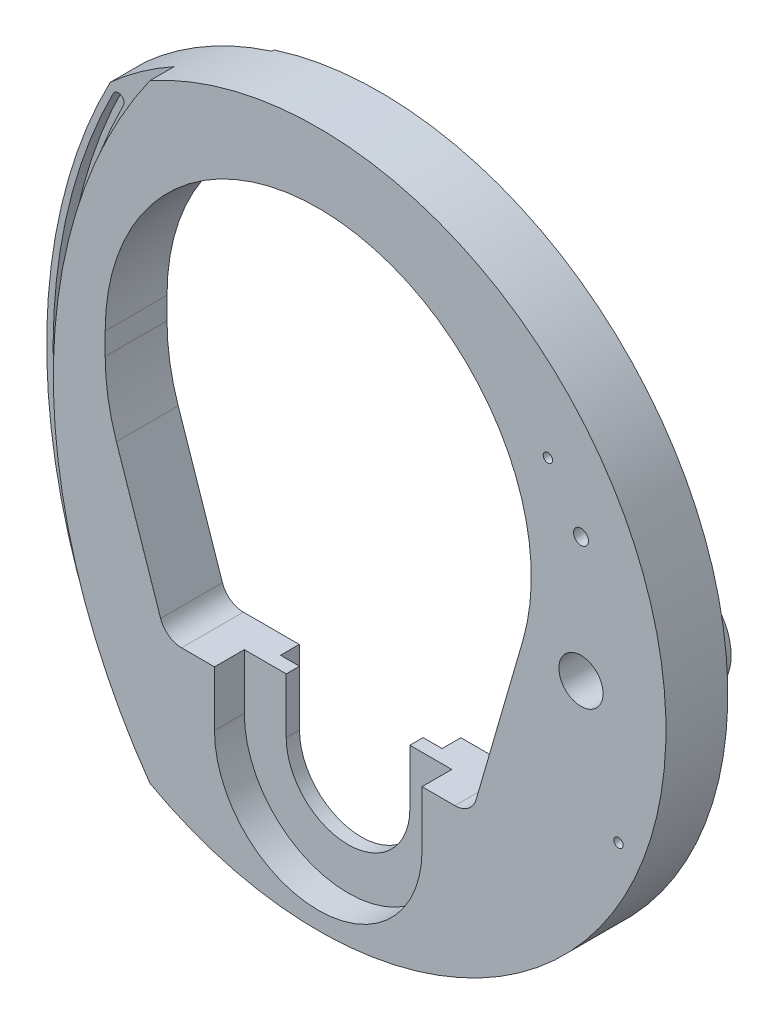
ISO-10303-21;
HEADER;
FILE_DESCRIPTION(('STEP AP214'),'2;1');
FILE_NAME('part.step','',(''),(''),'','','');
FILE_SCHEMA(('AUTOMOTIVE_DESIGN { 1 0 10303 214 1 1 1 1 }'));
ENDSEC;
DATA;
#1=APPLICATION_CONTEXT('core data for automotive mechanical design processes');
#2=APPLICATION_PROTOCOL_DEFINITION('international standard','automotive_design',2000,#1);
#3=PRODUCT_CONTEXT('',#1,'mechanical');
#4=PRODUCT('Part','Part','',(#3));
#5=PRODUCT_RELATED_PRODUCT_CATEGORY('part','',(#4));
#6=PRODUCT_DEFINITION_FORMATION('','',#4);
#7=PRODUCT_DEFINITION_CONTEXT('part definition',#1,'design');
#8=PRODUCT_DEFINITION('design','',#6,#7);
#9=PRODUCT_DEFINITION_SHAPE('','',#8);
#10=(LENGTH_UNIT() NAMED_UNIT(*) SI_UNIT(.MILLI.,.METRE.));
#11=(NAMED_UNIT(*) PLANE_ANGLE_UNIT() SI_UNIT($,.RADIAN.));
#12=(NAMED_UNIT(*) SI_UNIT($,.STERADIAN.) SOLID_ANGLE_UNIT());
#13=UNCERTAINTY_MEASURE_WITH_UNIT(LENGTH_MEASURE(1.E-05),#10,'distance_accuracy_value','');
#14=(GEOMETRIC_REPRESENTATION_CONTEXT(3) GLOBAL_UNCERTAINTY_ASSIGNED_CONTEXT((#13)) GLOBAL_UNIT_ASSIGNED_CONTEXT((#10,
#11,#12)) REPRESENTATION_CONTEXT('',''));
#15=CARTESIAN_POINT('',(0.,0.,0.));
#16=DIRECTION('',(0.,0.,1.));
#17=DIRECTION('',(1.,0.,0.));
#18=AXIS2_PLACEMENT_3D('',#15,#16,#17);
#19=CARTESIAN_POINT('',(119.,-29.5,17.));
#20=DIRECTION('',(0.,0.,1.));
#21=DIRECTION('',(1.,0.,0.));
#22=AXIS2_PLACEMENT_3D('',#19,#20,#21);
#23=PLANE('',#22);
#24=CARTESIAN_POINT('',(119.,-29.5,17.));
#25=DIRECTION('',(0.,0.,1.));
#26=DIRECTION('',(1.,0.,0.));
#27=AXIS2_PLACEMENT_3D('',#24,#25,#26);
#28=CIRCLE('',#27,250.1);
#29=CARTESIAN_POINT('',(-103.865257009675,83.9948774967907,17.));
#30=VERTEX_POINT('',#29);
#31=CARTESIAN_POINT('',(-99.0872268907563,-151.925371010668,17.));
#32=VERTEX_POINT('',#31);
#33=EDGE_CURVE('E490',#30,#32,#28,.T.);
#34=ORIENTED_EDGE('',*,*,#33,.F.);
#35=CARTESIAN_POINT('',(-101.548385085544,82.8150027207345,17.));
#36=DIRECTION('',(0.,0.,1.));
#37=DIRECTION('',(-1.,0.,0.));
#38=AXIS2_PLACEMENT_3D('',#35,#36,#37);
#39=CIRCLE('',#38,2.6);
#40=CARTESIAN_POINT('',(-99.231513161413,81.6351279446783,17.));
#41=VERTEX_POINT('',#40);
#42=EDGE_CURVE('E504',#41,#30,#39,.T.);
#43=ORIENTED_EDGE('',*,*,#42,.F.);
#44=CARTESIAN_POINT('',(119.,-29.5,17.));
#45=DIRECTION('',(0.,0.,-1.));
#46=DIRECTION('',(1.,0.,0.));
#47=AXIS2_PLACEMENT_3D('',#44,#45,#46);
#48=CIRCLE('',#47,244.9);
#49=CARTESIAN_POINT('',(-88.2721008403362,-159.938821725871,17.));
#50=VERTEX_POINT('',#49);
#51=EDGE_CURVE('E481',#50,#41,#48,.T.);
#52=ORIENTED_EDGE('',*,*,#51,.F.);
#53=CARTESIAN_POINT('',(0.,-29.5,17.));
#54=DIRECTION('',(0.,0.,1.));
#55=DIRECTION('',(1.,0.,0.));
#56=AXIS2_PLACEMENT_3D('',#53,#54,#55);
#57=CIRCLE('',#56,157.5);
#58=CARTESIAN_POINT('',(-76.2762605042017,-167.297612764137,17.));
#59=VERTEX_POINT('',#58);
#60=EDGE_CURVE('E858',#50,#59,#57,.T.);
#61=ORIENTED_EDGE('',*,*,#60,.T.);
#62=CARTESIAN_POINT('',(119.,-29.5,17.));
#63=DIRECTION('',(0.,0.,-1.));
#64=DIRECTION('',(1.,0.,0.));
#65=AXIS2_PLACEMENT_3D('',#62,#63,#64);
#66=CIRCLE('',#65,239.);
#67=CARTESIAN_POINT('',(-76.2762605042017,108.297612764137,17.));
#68=VERTEX_POINT('',#67);
#69=EDGE_CURVE('E523',#59,#68,#66,.T.);
#70=ORIENTED_EDGE('',*,*,#69,.T.);
#71=CARTESIAN_POINT('',(-105.21743697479,87.6987242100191,17.));
#72=VERTEX_POINT('',#71);
#73=EDGE_CURVE('E864',#68,#72,#57,.T.);
#74=ORIENTED_EDGE('',*,*,#73,.T.);
#75=CARTESIAN_POINT('',(119.,-29.5,17.));
#76=DIRECTION('',(0.,0.,1.));
#77=DIRECTION('',(1.,0.,0.));
#78=AXIS2_PLACEMENT_3D('',#75,#76,#77);
#79=CIRCLE('',#78,253.);
#80=CARTESIAN_POINT('',(-105.21743697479,-146.698724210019,17.));
#81=VERTEX_POINT('',#80);
#82=EDGE_CURVE('E527',#72,#81,#79,.T.);
#83=ORIENTED_EDGE('',*,*,#82,.T.);
#84=EDGE_CURVE('E859',#81,#32,#57,.T.);
#85=ORIENTED_EDGE('',*,*,#84,.T.);
#86=EDGE_LOOP('',(#34,#43,#52,#61,#70,#74,#83,#85));
#87=FACE_BOUND('',#86,.T.);
#88=ADVANCED_FACE('F47',(#87),#23,.T.);
#89=CARTESIAN_POINT('',(119.,-29.5,28.));
#90=DIRECTION('',(0.,0.,-1.));
#91=DIRECTION('',(-1.,0.,0.));
#92=AXIS2_PLACEMENT_3D('',#89,#90,#91);
#93=CYLINDRICAL_SURFACE('',#92,253.);
#94=ORIENTED_EDGE('',*,*,#82,.F.);
#95=DIRECTION('',(0.,0.,-1.));
#96=VECTOR('',#95,1.);
#97=CARTESIAN_POINT('',(-105.21743697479,87.6987242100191,28.));
#98=LINE('',#97,#96);
#99=CARTESIAN_POINT('',(-105.21743697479,87.6987242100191,1.));
#100=VERTEX_POINT('',#99);
#101=EDGE_CURVE('E799',#72,#100,#98,.T.);
#102=ORIENTED_EDGE('',*,*,#101,.T.);
#103=CARTESIAN_POINT('',(119.,-29.5,1.));
#104=DIRECTION('',(0.,0.,-1.));
#105=DIRECTION('',(-1.,0.,0.));
#106=AXIS2_PLACEMENT_3D('',#103,#104,#105);
#107=CIRCLE('',#106,253.);
#108=CARTESIAN_POINT('',(-105.21743697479,-146.698724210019,1.));
#109=VERTEX_POINT('',#108);
#110=EDGE_CURVE('E567',#109,#100,#107,.T.);
#111=ORIENTED_EDGE('',*,*,#110,.F.);
#112=DIRECTION('',(0.,0.,-1.));
#113=VECTOR('',#112,1.);
#114=CARTESIAN_POINT('',(-105.21743697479,-146.698724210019,28.));
#115=LINE('',#114,#113);
#116=EDGE_CURVE('E805',#81,#109,#115,.T.);
#117=ORIENTED_EDGE('',*,*,#116,.F.);
#118=EDGE_LOOP('',(#94,#102,#111,#117));
#119=FACE_BOUND('',#118,.T.);
#120=ADVANCED_FACE('F921',(#119),#93,.T.);
#121=CARTESIAN_POINT('',(59.5,-29.5,28.));
#122=DIRECTION('',(0.,0.,1.));
#123=DIRECTION('',(1.,0.,0.));
#124=AXIS2_PLACEMENT_3D('',#121,#122,#123);
#125=PLANE('',#124);
#126=CARTESIAN_POINT('',(104.,50.5,28.));
#127=DIRECTION('',(0.,0.,1.));
#128=DIRECTION('',(1.,0.,0.));
#129=AXIS2_PLACEMENT_3D('',#126,#127,#128);
#130=CIRCLE('',#129,2.1);
#131=CARTESIAN_POINT('',(106.1,50.5,28.));
#132=VERTEX_POINT('',#131);
#133=EDGE_CURVE('E453',#132,#132,#130,.T.);
#134=ORIENTED_EDGE('',*,*,#133,.F.);
#135=EDGE_LOOP('',(#134));
#136=FACE_BOUND('',#135,.T.);
#137=CARTESIAN_POINT('',(136.,-84.5,28.));
#138=DIRECTION('',(0.,0.,1.));
#139=DIRECTION('',(1.,0.,0.));
#140=AXIS2_PLACEMENT_3D('',#137,#138,#139);
#141=CIRCLE('',#140,2.09999999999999);
#142=CARTESIAN_POINT('',(138.1,-84.5,28.));
#143=VERTEX_POINT('',#142);
#144=EDGE_CURVE('E461',#143,#143,#141,.T.);
#145=ORIENTED_EDGE('',*,*,#144,.F.);
#146=EDGE_LOOP('',(#145));
#147=FACE_BOUND('',#146,.T.);
#148=CARTESIAN_POINT('',(119.,27.,28.));
#149=DIRECTION('',(0.,0.,-1.));
#150=DIRECTION('',(-1.,0.,0.));
#151=AXIS2_PLACEMENT_3D('',#148,#149,#150);
#152=CIRCLE('',#151,3.37499999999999);
#153=CARTESIAN_POINT('',(115.625,27.,28.));
#154=VERTEX_POINT('',#153);
#155=EDGE_CURVE('E465',#154,#154,#152,.T.);
#156=ORIENTED_EDGE('',*,*,#155,.T.);
#157=EDGE_LOOP('',(#156));
#158=FACE_BOUND('',#157,.T.);
#159=CARTESIAN_POINT('',(119.,-29.5,28.));
#160=DIRECTION('',(0.,0.,1.));
#161=DIRECTION('',(1.,0.,0.));
#162=AXIS2_PLACEMENT_3D('',#159,#160,#161);
#163=CIRCLE('',#162,9.99999999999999);
#164=CARTESIAN_POINT('',(129.,-29.5,28.));
#165=VERTEX_POINT('',#164);
#166=EDGE_CURVE('E687',#165,#165,#163,.T.);
#167=ORIENTED_EDGE('',*,*,#166,.F.);
#168=EDGE_LOOP('',(#167));
#169=FACE_BOUND('',#168,.T.);
#170=DIRECTION('',(0.,1.,0.));
#171=VECTOR('',#170,1.);
#172=CARTESIAN_POINT('',(47.,-97.0817878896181,28.));
#173=LINE('',#172,#171);
#174=CARTESIAN_POINT('',(47.,-132.,28.));
#175=VERTEX_POINT('',#174);
#176=CARTESIAN_POINT('',(47.,-107.,28.));
#177=VERTEX_POINT('',#176);
#178=EDGE_CURVE('E587',#175,#177,#173,.T.);
#179=ORIENTED_EDGE('',*,*,#178,.F.);
#180=CARTESIAN_POINT('',(0.,-132.,28.));
#181=DIRECTION('',(0.,0.,1.));
#182=DIRECTION('',(-1.,0.,0.));
#183=AXIS2_PLACEMENT_3D('',#180,#181,#182);
#184=CIRCLE('',#183,47.);
#185=CARTESIAN_POINT('',(-47.,-132.,28.));
#186=VERTEX_POINT('',#185);
#187=EDGE_CURVE('E597',#186,#175,#184,.T.);
#188=ORIENTED_EDGE('',*,*,#187,.F.);
#189=DIRECTION('',(0.,-1.,0.));
#190=VECTOR('',#189,1.);
#191=CARTESIAN_POINT('',(-47.,-97.0817878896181,28.));
#192=LINE('',#191,#190);
#193=CARTESIAN_POINT('',(-47.,-107.,28.));
#194=VERTEX_POINT('',#193);
#195=EDGE_CURVE('E582',#194,#186,#192,.T.);
#196=ORIENTED_EDGE('',*,*,#195,.F.);
#197=DIRECTION('',(1.,0.,0.));
#198=VECTOR('',#197,1.);
#199=CARTESIAN_POINT('',(-28.,-107.,28.));
#200=LINE('',#199,#198);
#201=CARTESIAN_POINT('',(-61.915,-107.,28.));
#202=VERTEX_POINT('',#201);
#203=EDGE_CURVE('E708',#202,#194,#200,.T.);
#204=ORIENTED_EDGE('',*,*,#203,.F.);
#205=CARTESIAN_POINT('',(-61.915,-97.,28.));
#206=DIRECTION('',(0.,0.,1.));
#207=DIRECTION('',(-1.,0.,0.));
#208=AXIS2_PLACEMENT_3D('',#205,#206,#207);
#209=CIRCLE('',#208,9.99999999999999);
#210=CARTESIAN_POINT('',(-71.3891425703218,-100.200097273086,28.));
#211=VERTEX_POINT('',#210);
#212=EDGE_CURVE('E705',#211,#202,#209,.T.);
#213=ORIENTED_EDGE('',*,*,#212,.F.);
#214=DIRECTION('',(0.320009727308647,-0.947414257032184,0.));
#215=VECTOR('',#214,1.);
#216=CARTESIAN_POINT('',(-91.4254758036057,-40.8809386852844,28.));
#217=LINE('',#216,#215);
#218=CARTESIAN_POINT('',(-91.4254758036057,-40.8809386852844,28.));
#219=VERTEX_POINT('',#218);
#220=EDGE_CURVE('E702',#219,#211,#217,.T.);
#221=ORIENTED_EDGE('',*,*,#220,.F.);
#222=CARTESIAN_POINT('',(0.,-10.,28.));
#223=DIRECTION('',(0.,0.,1.));
#224=DIRECTION('',(1.,0.,0.));
#225=AXIS2_PLACEMENT_3D('',#222,#223,#224);
#226=CIRCLE('',#225,96.4999999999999);
#227=CARTESIAN_POINT('',(-96.4999999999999,-9.99999999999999,28.));
#228=VERTEX_POINT('',#227);
#229=EDGE_CURVE('E699',#228,#219,#226,.T.);
#230=ORIENTED_EDGE('',*,*,#229,.F.);
#231=DIRECTION('',(0.,-1.,0.));
#232=VECTOR('',#231,1.);
#233=CARTESIAN_POINT('',(-96.4999999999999,0.,28.));
#234=LINE('',#233,#232);
#235=CARTESIAN_POINT('',(-96.4999999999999,0.,28.));
#236=VERTEX_POINT('',#235);
#237=EDGE_CURVE('E695',#236,#228,#234,.T.);
#238=ORIENTED_EDGE('',*,*,#237,.F.);
#239=CARTESIAN_POINT('',(0.,0.,28.));
#240=DIRECTION('',(0.,0.,1.));
#241=DIRECTION('',(1.,0.,0.));
#242=AXIS2_PLACEMENT_3D('',#239,#240,#241);
#243=CIRCLE('',#242,96.4999999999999);
#244=CARTESIAN_POINT('',(92.6749796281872,-26.8997797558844,28.));
#245=VERTEX_POINT('',#244);
#246=EDGE_CURVE('E692',#245,#236,#243,.T.);
#247=ORIENTED_EDGE('',*,*,#246,.F.);
#248=DIRECTION('',(0.278754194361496,0.96036248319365,0.));
#249=VECTOR('',#248,1.);
#250=CARTESIAN_POINT('',(92.6749796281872,-26.8997797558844,28.));
#251=LINE('',#250,#249);
#252=CARTESIAN_POINT('',(71.5186248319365,-99.7875419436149,28.));
#253=VERTEX_POINT('',#252);
#254=EDGE_CURVE('E719',#253,#245,#251,.T.);
#255=ORIENTED_EDGE('',*,*,#254,.F.);
#256=CARTESIAN_POINT('',(61.915,-96.9999999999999,28.));
#257=DIRECTION('',(0.,0.,1.));
#258=DIRECTION('',(-1.,0.,0.));
#259=AXIS2_PLACEMENT_3D('',#256,#257,#258);
#260=CIRCLE('',#259,9.99999999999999);
#261=CARTESIAN_POINT('',(61.915,-107.,28.));
#262=VERTEX_POINT('',#261);
#263=EDGE_CURVE('E715',#262,#253,#260,.T.);
#264=ORIENTED_EDGE('',*,*,#263,.F.);
#265=DIRECTION('',(1.,0.,0.));
#266=VECTOR('',#265,1.);
#267=CARTESIAN_POINT('',(61.915,-107.,28.));
#268=LINE('',#267,#266);
#269=EDGE_CURVE('E712',#177,#262,#268,.T.);
#270=ORIENTED_EDGE('',*,*,#269,.F.);
#271=EDGE_LOOP('',(#179,#188,#196,#204,#213,#221,#230,#238,#247,#255,#264,#270));
#272=FACE_BOUND('',#271,.T.);
#273=CARTESIAN_POINT('',(119.,-29.5,28.));
#274=DIRECTION('',(0.,0.,-1.));
#275=DIRECTION('',(1.,0.,0.));
#276=AXIS2_PLACEMENT_3D('',#273,#274,#275);
#277=CIRCLE('',#276,239.);
#278=CARTESIAN_POINT('',(-76.2762605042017,-167.297612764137,28.));
#279=VERTEX_POINT('',#278);
#280=CARTESIAN_POINT('',(-76.2762605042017,108.297612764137,28.));
#281=VERTEX_POINT('',#280);
#282=EDGE_CURVE('E514',#279,#281,#277,.T.);
#283=ORIENTED_EDGE('',*,*,#282,.F.);
#284=CARTESIAN_POINT('',(0.,-29.5,28.));
#285=DIRECTION('',(0.,0.,1.));
#286=DIRECTION('',(1.,0.,0.));
#287=AXIS2_PLACEMENT_3D('',#284,#285,#286);
#288=CIRCLE('',#287,157.5);
#289=EDGE_CURVE('E795',#279,#281,#288,.T.);
#290=ORIENTED_EDGE('',*,*,#289,.T.);
#291=EDGE_LOOP('',(#283,#290));
#292=FACE_BOUND('',#291,.T.);
#293=ADVANCED_FACE('F927',(#136,#147,#158,#169,#272,#292),#125,.T.);
#294=CARTESIAN_POINT('',(59.5,-29.5,0.));
#295=DIRECTION('',(0.,0.,1.));
#296=DIRECTION('',(1.,0.,0.));
#297=AXIS2_PLACEMENT_3D('',#294,#295,#296);
#298=PLANE('',#297);
#299=DIRECTION('',(0.,-1.,0.));
#300=VECTOR('',#299,1.);
#301=CARTESIAN_POINT('',(27.,120.5,0.));
#302=LINE('',#301,#300);
#303=CARTESIAN_POINT('',(27.,120.5,0.));
#304=VERTEX_POINT('',#303);
#305=CARTESIAN_POINT('',(27.,102.,0.));
#306=VERTEX_POINT('',#305);
#307=EDGE_CURVE('E394',#304,#306,#302,.T.);
#308=ORIENTED_EDGE('',*,*,#307,.F.);
#309=CARTESIAN_POINT('',(25.,120.5,0.));
#310=DIRECTION('',(0.,0.,-1.));
#311=DIRECTION('',(0.,1.,0.));
#312=AXIS2_PLACEMENT_3D('',#309,#310,#311);
#313=CIRCLE('',#312,2.);
#314=CARTESIAN_POINT('',(25.,122.5,0.));
#315=VERTEX_POINT('',#314);
#316=EDGE_CURVE('E63',#315,#304,#313,.T.);
#317=ORIENTED_EDGE('',*,*,#316,.F.);
#318=DIRECTION('',(1.,0.,0.));
#319=VECTOR('',#318,1.);
#320=CARTESIAN_POINT('',(25.,122.5,0.));
#321=LINE('',#320,#319);
#322=CARTESIAN_POINT('',(-25.,122.5,0.));
#323=VERTEX_POINT('',#322);
#324=EDGE_CURVE('E366',#323,#315,#321,.T.);
#325=ORIENTED_EDGE('',*,*,#324,.F.);
#326=CARTESIAN_POINT('',(-25.,120.5,0.));
#327=DIRECTION('',(0.,0.,-1.));
#328=DIRECTION('',(0.,1.,0.));
#329=AXIS2_PLACEMENT_3D('',#326,#327,#328);
#330=CIRCLE('',#329,2.);
#331=CARTESIAN_POINT('',(-27.,120.5,0.));
#332=VERTEX_POINT('',#331);
#333=EDGE_CURVE('E370',#332,#323,#330,.T.);
#334=ORIENTED_EDGE('',*,*,#333,.F.);
#335=DIRECTION('',(0.,1.,0.));
#336=VECTOR('',#335,1.);
#337=CARTESIAN_POINT('',(-27.,120.5,0.));
#338=LINE('',#337,#336);
#339=CARTESIAN_POINT('',(-27.,102.,0.));
#340=VERTEX_POINT('',#339);
#341=EDGE_CURVE('E409',#340,#332,#338,.T.);
#342=ORIENTED_EDGE('',*,*,#341,.F.);
#343=CARTESIAN_POINT('',(-25.,102.,0.));
#344=DIRECTION('',(0.,0.,-1.));
#345=DIRECTION('',(0.,1.,0.));
#346=AXIS2_PLACEMENT_3D('',#343,#344,#345);
#347=CIRCLE('',#346,2.);
#348=CARTESIAN_POINT('',(-25.,100.,0.));
#349=VERTEX_POINT('',#348);
#350=EDGE_CURVE('E405',#349,#340,#347,.T.);
#351=ORIENTED_EDGE('',*,*,#350,.F.);
#352=DIRECTION('',(-1.,0.,0.));
#353=VECTOR('',#352,1.);
#354=CARTESIAN_POINT('',(25.,100.,0.));
#355=LINE('',#354,#353);
#356=CARTESIAN_POINT('',(25.,100.,0.));
#357=VERTEX_POINT('',#356);
#358=EDGE_CURVE('E401',#357,#349,#355,.T.);
#359=ORIENTED_EDGE('',*,*,#358,.F.);
#360=CARTESIAN_POINT('',(25.,102.,0.));
#361=DIRECTION('',(0.,0.,-1.));
#362=DIRECTION('',(0.,1.,0.));
#363=AXIS2_PLACEMENT_3D('',#360,#361,#362);
#364=CIRCLE('',#363,2.);
#365=EDGE_CURVE('E397',#306,#357,#364,.T.);
#366=ORIENTED_EDGE('',*,*,#365,.F.);
#367=EDGE_LOOP('',(#308,#317,#325,#334,#342,#351,#359,#366));
#368=FACE_BOUND('',#367,.T.);
#369=CARTESIAN_POINT('',(119.,27.,0.));
#370=DIRECTION('',(0.,0.,-1.));
#371=DIRECTION('',(-1.,0.,0.));
#372=AXIS2_PLACEMENT_3D('',#369,#370,#371);
#373=CIRCLE('',#372,3.375);
#374=CARTESIAN_POINT('',(115.625,27.,0.));
#375=VERTEX_POINT('',#374);
#376=EDGE_CURVE('E469',#375,#375,#373,.T.);
#377=ORIENTED_EDGE('',*,*,#376,.F.);
#378=EDGE_LOOP('',(#377));
#379=FACE_BOUND('',#378,.T.);
#380=CARTESIAN_POINT('',(54.6,-132.,0.));
#381=DIRECTION('',(0.,0.,1.));
#382=DIRECTION('',(1.,0.,0.));
#383=AXIS2_PLACEMENT_3D('',#380,#381,#382);
#384=CIRCLE('',#383,5.9);
#385=CARTESIAN_POINT('',(60.5,-132.,0.));
#386=VERTEX_POINT('',#385);
#387=EDGE_CURVE('E56',#386,#386,#384,.T.);
#388=ORIENTED_EDGE('',*,*,#387,.T.);
#389=EDGE_LOOP('',(#388));
#390=FACE_BOUND('',#389,.T.);
#391=CARTESIAN_POINT('',(-54.6,-132.,0.));
#392=DIRECTION('',(0.,0.,1.));
#393=DIRECTION('',(1.,0.,0.));
#394=AXIS2_PLACEMENT_3D('',#391,#392,#393);
#395=CIRCLE('',#394,5.9);
#396=CARTESIAN_POINT('',(-48.7,-132.,0.));
#397=VERTEX_POINT('',#396);
#398=EDGE_CURVE('E892',#397,#397,#395,.T.);
#399=ORIENTED_EDGE('',*,*,#398,.T.);
#400=EDGE_LOOP('',(#399));
#401=FACE_BOUND('',#400,.T.);
#402=CARTESIAN_POINT('',(43.6,-117.,0.));
#403=DIRECTION('',(0.,0.,1.));
#404=DIRECTION('',(1.,0.,0.));
#405=AXIS2_PLACEMENT_3D('',#402,#403,#404);
#406=CIRCLE('',#405,3.50000000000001);
#407=CARTESIAN_POINT('',(47.1,-117.,0.));
#408=VERTEX_POINT('',#407);
#409=EDGE_CURVE('E880',#408,#408,#406,.T.);
#410=ORIENTED_EDGE('',*,*,#409,.T.);
#411=EDGE_LOOP('',(#410));
#412=FACE_BOUND('',#411,.T.);
#413=CARTESIAN_POINT('',(-43.6,-117.,0.));
#414=DIRECTION('',(0.,0.,1.));
#415=DIRECTION('',(1.,0.,0.));
#416=AXIS2_PLACEMENT_3D('',#413,#414,#415);
#417=CIRCLE('',#416,3.50000000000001);
#418=CARTESIAN_POINT('',(-40.1,-117.,0.));
#419=VERTEX_POINT('',#418);
#420=EDGE_CURVE('E876',#419,#419,#417,.T.);
#421=ORIENTED_EDGE('',*,*,#420,.T.);
#422=EDGE_LOOP('',(#421));
#423=FACE_BOUND('',#422,.T.);
#424=CARTESIAN_POINT('',(119.012549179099,-29.4702294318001,0.));
#425=DIRECTION('',(0.,0.,1.));
#426=DIRECTION('',(1.,0.,0.));
#427=AXIS2_PLACEMENT_3D('',#424,#425,#426);
#428=CIRCLE('',#427,26.);
#429=CARTESIAN_POINT('',(145.012549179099,-29.4702294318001,0.));
#430=VERTEX_POINT('',#429);
#431=EDGE_CURVE('E831',#430,#430,#428,.T.);
#432=ORIENTED_EDGE('',*,*,#431,.T.);
#433=EDGE_LOOP('',(#432));
#434=FACE_BOUND('',#433,.T.);
#435=DIRECTION('',(1.,0.,0.));
#436=VECTOR('',#435,1.);
#437=CARTESIAN_POINT('',(-28.,-107.,0.));
#438=LINE('',#437,#436);
#439=CARTESIAN_POINT('',(-61.915,-107.,0.));
#440=VERTEX_POINT('',#439);
#441=CARTESIAN_POINT('',(-36.6,-107.,0.));
#442=VERTEX_POINT('',#441);
#443=EDGE_CURVE('E742',#440,#442,#438,.T.);
#444=ORIENTED_EDGE('',*,*,#443,.T.);
#445=DIRECTION('',(0.,1.,0.));
#446=VECTOR('',#445,1.);
#447=CARTESIAN_POINT('',(-36.6,-95.9365510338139,0.));
#448=LINE('',#447,#446);
#449=CARTESIAN_POINT('',(-36.6,-153.5,0.));
#450=VERTEX_POINT('',#449);
#451=EDGE_CURVE('E626',#450,#442,#448,.T.);
#452=ORIENTED_EDGE('',*,*,#451,.F.);
#453=CARTESIAN_POINT('',(-21.6,-153.5,0.));
#454=DIRECTION('',(0.,0.,-1.));
#455=DIRECTION('',(-1.,0.,0.));
#456=AXIS2_PLACEMENT_3D('',#453,#454,#455);
#457=CIRCLE('',#456,15.);
#458=CARTESIAN_POINT('',(-21.6,-168.5,0.));
#459=VERTEX_POINT('',#458);
#460=EDGE_CURVE('E653',#459,#450,#457,.T.);
#461=ORIENTED_EDGE('',*,*,#460,.F.);
#462=DIRECTION('',(-1.,0.,0.));
#463=VECTOR('',#462,1.);
#464=CARTESIAN_POINT('',(-21.6,-168.5,0.));
#465=LINE('',#464,#463);
#466=CARTESIAN_POINT('',(21.6,-168.5,0.));
#467=VERTEX_POINT('',#466);
#468=EDGE_CURVE('E649',#467,#459,#465,.T.);
#469=ORIENTED_EDGE('',*,*,#468,.F.);
#470=CARTESIAN_POINT('',(21.6,-153.5,0.));
#471=DIRECTION('',(0.,0.,-1.));
#472=DIRECTION('',(1.,0.,0.));
#473=AXIS2_PLACEMENT_3D('',#470,#471,#472);
#474=CIRCLE('',#473,15.);
#475=CARTESIAN_POINT('',(36.6,-153.5,0.));
#476=VERTEX_POINT('',#475);
#477=EDGE_CURVE('E645',#476,#467,#474,.T.);
#478=ORIENTED_EDGE('',*,*,#477,.F.);
#479=DIRECTION('',(0.,-1.,0.));
#480=VECTOR('',#479,1.);
#481=CARTESIAN_POINT('',(36.6,-95.9365510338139,0.));
#482=LINE('',#481,#480);
#483=CARTESIAN_POINT('',(36.6,-107.,0.));
#484=VERTEX_POINT('',#483);
#485=EDGE_CURVE('E621',#484,#476,#482,.T.);
#486=ORIENTED_EDGE('',*,*,#485,.F.);
#487=DIRECTION('',(1.,0.,0.));
#488=VECTOR('',#487,1.);
#489=CARTESIAN_POINT('',(61.915,-107.,0.));
#490=LINE('',#489,#488);
#491=CARTESIAN_POINT('',(61.915,-107.,0.));
#492=VERTEX_POINT('',#491);
#493=EDGE_CURVE('E746',#484,#492,#490,.T.);
#494=ORIENTED_EDGE('',*,*,#493,.T.);
#495=CARTESIAN_POINT('',(61.915,-96.9999999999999,0.));
#496=DIRECTION('',(0.,0.,1.));
#497=DIRECTION('',(-1.,0.,0.));
#498=AXIS2_PLACEMENT_3D('',#495,#496,#497);
#499=CIRCLE('',#498,9.99999999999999);
#500=CARTESIAN_POINT('',(71.5186248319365,-99.7875419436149,0.));
#501=VERTEX_POINT('',#500);
#502=EDGE_CURVE('E749',#492,#501,#499,.T.);
#503=ORIENTED_EDGE('',*,*,#502,.T.);
#504=DIRECTION('',(0.278754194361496,0.96036248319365,0.));
#505=VECTOR('',#504,1.);
#506=CARTESIAN_POINT('',(92.6749796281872,-26.8997797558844,0.));
#507=LINE('',#506,#505);
#508=CARTESIAN_POINT('',(92.6749796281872,-26.8997797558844,0.));
#509=VERTEX_POINT('',#508);
#510=EDGE_CURVE('E696',#501,#509,#507,.T.);
#511=ORIENTED_EDGE('',*,*,#510,.T.);
#512=CARTESIAN_POINT('',(0.,0.,0.));
#513=DIRECTION('',(0.,0.,1.));
#514=DIRECTION('',(1.,0.,0.));
#515=AXIS2_PLACEMENT_3D('',#512,#513,#514);
#516=CIRCLE('',#515,96.4999999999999);
#517=CARTESIAN_POINT('',(-96.4999999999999,0.,0.));
#518=VERTEX_POINT('',#517);
#519=EDGE_CURVE('E691',#509,#518,#516,.T.);
#520=ORIENTED_EDGE('',*,*,#519,.T.);
#521=DIRECTION('',(0.,-1.,0.));
#522=VECTOR('',#521,1.);
#523=CARTESIAN_POINT('',(-96.4999999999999,0.,0.));
#524=LINE('',#523,#522);
#525=CARTESIAN_POINT('',(-96.4999999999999,-9.99999999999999,0.));
#526=VERTEX_POINT('',#525);
#527=EDGE_CURVE('E726',#518,#526,#524,.T.);
#528=ORIENTED_EDGE('',*,*,#527,.T.);
#529=CARTESIAN_POINT('',(0.,-10.,0.));
#530=DIRECTION('',(0.,0.,1.));
#531=DIRECTION('',(1.,0.,0.));
#532=AXIS2_PLACEMENT_3D('',#529,#530,#531);
#533=CIRCLE('',#532,96.4999999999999);
#534=CARTESIAN_POINT('',(-91.4254758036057,-40.8809386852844,0.));
#535=VERTEX_POINT('',#534);
#536=EDGE_CURVE('E730',#526,#535,#533,.T.);
#537=ORIENTED_EDGE('',*,*,#536,.T.);
#538=DIRECTION('',(0.320009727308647,-0.947414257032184,0.));
#539=VECTOR('',#538,1.);
#540=CARTESIAN_POINT('',(-91.4254758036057,-40.8809386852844,0.));
#541=LINE('',#540,#539);
#542=CARTESIAN_POINT('',(-71.3891425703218,-100.200097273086,0.));
#543=VERTEX_POINT('',#542);
#544=EDGE_CURVE('E734',#535,#543,#541,.T.);
#545=ORIENTED_EDGE('',*,*,#544,.T.);
#546=CARTESIAN_POINT('',(-61.915,-97.,0.));
#547=DIRECTION('',(0.,0.,1.));
#548=DIRECTION('',(-1.,0.,0.));
#549=AXIS2_PLACEMENT_3D('',#546,#547,#548);
#550=CIRCLE('',#549,9.99999999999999);
#551=EDGE_CURVE('E738',#543,#440,#550,.T.);
#552=ORIENTED_EDGE('',*,*,#551,.T.);
#553=EDGE_LOOP('',(#444,#452,#461,#469,#478,#486,#494,#503,#511,#520,#528,#537,#545,#552));
#554=FACE_BOUND('',#553,.T.);
#555=CARTESIAN_POINT('',(0.,-29.5,0.));
#556=DIRECTION('',(0.,0.,1.));
#557=DIRECTION('',(1.,0.,0.));
#558=AXIS2_PLACEMENT_3D('',#555,#556,#557);
#559=CIRCLE('',#558,157.5);
#560=CARTESIAN_POINT('',(-48.0378151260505,-179.495394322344,0.));
#561=VERTEX_POINT('',#560);
#562=CARTESIAN_POINT('',(-48.0378151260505,120.495394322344,0.));
#563=VERTEX_POINT('',#562);
#564=EDGE_CURVE('E794',#561,#563,#559,.T.);
#565=ORIENTED_EDGE('',*,*,#564,.F.);
#566=CARTESIAN_POINT('',(119.,-29.5,0.));
#567=DIRECTION('',(0.,0.,1.));
#568=DIRECTION('',(-1.,0.,0.));
#569=AXIS2_PLACEMENT_3D('',#566,#567,#568);
#570=CIRCLE('',#569,224.5);
#571=EDGE_CURVE('E552',#563,#561,#570,.T.);
#572=ORIENTED_EDGE('',*,*,#571,.F.);
#573=EDGE_LOOP('',(#565,#572));
#574=FACE_BOUND('',#573,.T.);
#575=ADVANCED_FACE('F899',(#368,#379,#390,#401,#412,#423,#434,#554,#574),#298,.F.);
#576=CARTESIAN_POINT('',(0.,-29.5,28.));
#577=DIRECTION('',(0.,0.,-1.));
#578=DIRECTION('',(-1.,0.,0.));
#579=AXIS2_PLACEMENT_3D('',#576,#577,#578);
#580=CYLINDRICAL_SURFACE('',#579,157.5);
#581=CARTESIAN_POINT('',(0.,-29.5,12.));
#582=DIRECTION('',(0.,0.,1.));
#583=DIRECTION('',(1.,0.,0.));
#584=AXIS2_PLACEMENT_3D('',#581,#582,#583);
#585=CIRCLE('',#584,157.5);
#586=CARTESIAN_POINT('',(-99.0872268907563,-151.925371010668,12.));
#587=VERTEX_POINT('',#586);
#588=CARTESIAN_POINT('',(-88.2721008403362,-159.938821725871,12.));
#589=VERTEX_POINT('',#588);
#590=EDGE_CURVE('E485',#587,#589,#585,.T.);
#591=ORIENTED_EDGE('',*,*,#590,.F.);
#592=DIRECTION('',(0.,0.,1.));
#593=VECTOR('',#592,1.);
#594=CARTESIAN_POINT('',(-99.0872268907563,-151.925371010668,12.));
#595=LINE('',#594,#593);
#596=EDGE_CURVE('E510',#587,#32,#595,.T.);
#597=ORIENTED_EDGE('',*,*,#596,.T.);
#598=ORIENTED_EDGE('',*,*,#84,.F.);
#599=ORIENTED_EDGE('',*,*,#116,.T.);
#600=CARTESIAN_POINT('',(0.,-29.5,1.));
#601=DIRECTION('',(0.,0.,-1.));
#602=DIRECTION('',(-1.,0.,0.));
#603=AXIS2_PLACEMENT_3D('',#600,#601,#602);
#604=CIRCLE('',#603,157.5);
#605=CARTESIAN_POINT('',(-48.0378151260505,-179.495394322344,1.));
#606=VERTEX_POINT('',#605);
#607=EDGE_CURVE('E835',#606,#109,#604,.T.);
#608=ORIENTED_EDGE('',*,*,#607,.F.);
#609=DIRECTION('',(0.,0.,-1.));
#610=VECTOR('',#609,1.);
#611=CARTESIAN_POINT('',(-48.0378151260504,-179.495394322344,0.5));
#612=LINE('',#611,#610);
#613=EDGE_CURVE('E839',#606,#561,#612,.T.);
#614=ORIENTED_EDGE('',*,*,#613,.T.);
#615=ORIENTED_EDGE('',*,*,#564,.T.);
#616=DIRECTION('',(0.,0.,-1.));
#617=VECTOR('',#616,1.);
#618=CARTESIAN_POINT('',(-48.0378151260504,120.495394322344,0.5));
#619=LINE('',#618,#617);
#620=CARTESIAN_POINT('',(-48.0378151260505,120.495394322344,1.));
#621=VERTEX_POINT('',#620);
#622=EDGE_CURVE('E844',#563,#621,#619,.F.);
#623=ORIENTED_EDGE('',*,*,#622,.T.);
#624=EDGE_CURVE('E840',#100,#621,#604,.T.);
#625=ORIENTED_EDGE('',*,*,#624,.F.);
#626=ORIENTED_EDGE('',*,*,#101,.F.);
#627=ORIENTED_EDGE('',*,*,#73,.F.);
#628=DIRECTION('',(0.,0.,1.));
#629=VECTOR('',#628,1.);
#630=CARTESIAN_POINT('',(-76.2762605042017,108.297612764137,22.5));
#631=LINE('',#630,#629);
#632=EDGE_CURVE('E868',#68,#281,#631,.T.);
#633=ORIENTED_EDGE('',*,*,#632,.T.);
#634=ORIENTED_EDGE('',*,*,#289,.F.);
#635=DIRECTION('',(0.,0.,1.));
#636=VECTOR('',#635,1.);
#637=CARTESIAN_POINT('',(-76.2762605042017,-167.297612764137,22.5));
#638=LINE('',#637,#636);
#639=EDGE_CURVE('E863',#279,#59,#638,.F.);
#640=ORIENTED_EDGE('',*,*,#639,.T.);
#641=ORIENTED_EDGE('',*,*,#60,.F.);
#642=DIRECTION('',(0.,0.,1.));
#643=VECTOR('',#642,1.);
#644=CARTESIAN_POINT('',(-88.2721008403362,-159.938821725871,12.));
#645=LINE('',#644,#643);
#646=EDGE_CURVE('E71',#589,#50,#645,.T.);
#647=ORIENTED_EDGE('',*,*,#646,.F.);
#648=EDGE_LOOP('',(#591,#597,#598,#599,#608,#614,#615,#623,#625,#626,#627,#633,#634,#640,#641,#647));
#649=FACE_BOUND('',#648,.T.);
#650=ADVANCED_FACE('F1064',(#649),#580,.T.);
#651=CARTESIAN_POINT('',(0.,0.,28.));
#652=DIRECTION('',(0.,0.,-1.));
#653=DIRECTION('',(-1.,0.,0.));
#654=AXIS2_PLACEMENT_3D('',#651,#652,#653);
#655=CYLINDRICAL_SURFACE('',#654,96.4999999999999);
#656=ORIENTED_EDGE('',*,*,#519,.F.);
#657=DIRECTION('',(0.,0.,-1.));
#658=VECTOR('',#657,1.);
#659=CARTESIAN_POINT('',(92.6749796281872,-26.8997797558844,28.));
#660=LINE('',#659,#658);
#661=EDGE_CURVE('E722',#245,#509,#660,.T.);
#662=ORIENTED_EDGE('',*,*,#661,.F.);
#663=ORIENTED_EDGE('',*,*,#246,.T.);
#664=DIRECTION('',(0.,0.,-1.));
#665=VECTOR('',#664,1.);
#666=CARTESIAN_POINT('',(-96.4999999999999,0.,28.));
#667=LINE('',#666,#665);
#668=EDGE_CURVE('E790',#236,#518,#667,.T.);
#669=ORIENTED_EDGE('',*,*,#668,.T.);
#670=EDGE_LOOP('',(#656,#662,#663,#669));
#671=FACE_BOUND('',#670,.T.);
#672=ADVANCED_FACE('F1060',(#671),#655,.F.);
#673=CARTESIAN_POINT('',(-96.4999999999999,0.,28.));
#674=DIRECTION('',(1.,0.,0.));
#675=DIRECTION('',(0.,1.,0.));
#676=AXIS2_PLACEMENT_3D('',#673,#674,#675);
#677=PLANE('',#676);
#678=ORIENTED_EDGE('',*,*,#527,.F.);
#679=ORIENTED_EDGE('',*,*,#668,.F.);
#680=ORIENTED_EDGE('',*,*,#237,.T.);
#681=DIRECTION('',(0.,0.,-1.));
#682=VECTOR('',#681,1.);
#683=CARTESIAN_POINT('',(-96.4999999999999,-9.99999999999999,28.));
#684=LINE('',#683,#682);
#685=EDGE_CURVE('E787',#228,#526,#684,.T.);
#686=ORIENTED_EDGE('',*,*,#685,.T.);
#687=EDGE_LOOP('',(#678,#679,#680,#686));
#688=FACE_BOUND('',#687,.T.);
#689=ADVANCED_FACE('F1056',(#688),#677,.T.);
#690=CARTESIAN_POINT('',(0.,-10.,28.));
#691=DIRECTION('',(0.,0.,-1.));
#692=DIRECTION('',(-1.,0.,0.));
#693=AXIS2_PLACEMENT_3D('',#690,#691,#692);
#694=CYLINDRICAL_SURFACE('',#693,96.4999999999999);
#695=ORIENTED_EDGE('',*,*,#536,.F.);
#696=ORIENTED_EDGE('',*,*,#685,.F.);
#697=ORIENTED_EDGE('',*,*,#229,.T.);
#698=DIRECTION('',(0.,0.,-1.));
#699=VECTOR('',#698,1.);
#700=CARTESIAN_POINT('',(-91.4254758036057,-40.8809386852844,28.));
#701=LINE('',#700,#699);
#702=EDGE_CURVE('E784',#219,#535,#701,.T.);
#703=ORIENTED_EDGE('',*,*,#702,.T.);
#704=EDGE_LOOP('',(#695,#696,#697,#703));
#705=FACE_BOUND('',#704,.T.);
#706=ADVANCED_FACE('F1052',(#705),#694,.F.);
#707=CARTESIAN_POINT('',(-91.4254758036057,-40.8809386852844,28.));
#708=DIRECTION('',(0.947414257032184,0.320009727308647,0.));
#709=DIRECTION('',(-0.320009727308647,0.947414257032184,0.));
#710=AXIS2_PLACEMENT_3D('',#707,#708,#709);
#711=PLANE('',#710);
#712=ORIENTED_EDGE('',*,*,#544,.F.);
#713=ORIENTED_EDGE('',*,*,#702,.F.);
#714=ORIENTED_EDGE('',*,*,#220,.T.);
#715=DIRECTION('',(0.,0.,-1.));
#716=VECTOR('',#715,1.);
#717=CARTESIAN_POINT('',(-71.3891425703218,-100.200097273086,28.));
#718=LINE('',#717,#716);
#719=EDGE_CURVE('E781',#211,#543,#718,.T.);
#720=ORIENTED_EDGE('',*,*,#719,.T.);
#721=EDGE_LOOP('',(#712,#713,#714,#720));
#722=FACE_BOUND('',#721,.T.);
#723=ADVANCED_FACE('F1048',(#722),#711,.T.);
#724=CARTESIAN_POINT('',(-61.915,-97.,28.));
#725=DIRECTION('',(0.,0.,-1.));
#726=DIRECTION('',(-1.,0.,0.));
#727=AXIS2_PLACEMENT_3D('',#724,#725,#726);
#728=CYLINDRICAL_SURFACE('',#727,9.99999999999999);
#729=ORIENTED_EDGE('',*,*,#551,.F.);
#730=ORIENTED_EDGE('',*,*,#719,.F.);
#731=ORIENTED_EDGE('',*,*,#212,.T.);
#732=DIRECTION('',(0.,0.,-1.));
#733=VECTOR('',#732,1.);
#734=CARTESIAN_POINT('',(-61.915,-107.,28.));
#735=LINE('',#734,#733);
#736=EDGE_CURVE('E778',#202,#440,#735,.T.);
#737=ORIENTED_EDGE('',*,*,#736,.T.);
#738=EDGE_LOOP('',(#729,#730,#731,#737));
#739=FACE_BOUND('',#738,.T.);
#740=ADVANCED_FACE('F1044',(#739),#728,.F.);
#741=CARTESIAN_POINT('',(-28.,-107.,28.));
#742=DIRECTION('',(0.,1.,0.));
#743=DIRECTION('',(-1.,0.,0.));
#744=AXIS2_PLACEMENT_3D('',#741,#742,#743);
#745=PLANE('',#744);
#746=DIRECTION('',(0.,0.,1.));
#747=VECTOR('',#746,1.);
#748=CARTESIAN_POINT('',(-47.,-107.,28.));
#749=LINE('',#748,#747);
#750=CARTESIAN_POINT('',(-47.,-107.,14.5));
#751=VERTEX_POINT('',#750);
#752=EDGE_CURVE('E824',#751,#194,#749,.T.);
#753=ORIENTED_EDGE('',*,*,#752,.F.);
#754=DIRECTION('',(-1.,0.,0.));
#755=VECTOR('',#754,1.);
#756=CARTESIAN_POINT('',(-28.,-107.,14.5));
#757=LINE('',#756,#755);
#758=CARTESIAN_POINT('',(-28.,-107.,14.5));
#759=VERTEX_POINT('',#758);
#760=EDGE_CURVE('E618',#759,#751,#757,.T.);
#761=ORIENTED_EDGE('',*,*,#760,.F.);
#762=DIRECTION('',(0.,0.,-1.));
#763=VECTOR('',#762,1.);
#764=CARTESIAN_POINT('',(-28.,-107.,28.));
#765=LINE('',#764,#763);
#766=CARTESIAN_POINT('',(-28.,-107.,8.5));
#767=VERTEX_POINT('',#766);
#768=EDGE_CURVE('E775',#759,#767,#765,.T.);
#769=ORIENTED_EDGE('',*,*,#768,.T.);
#770=DIRECTION('',(1.,0.,0.));
#771=VECTOR('',#770,1.);
#772=CARTESIAN_POINT('',(-28.,-107.,8.5));
#773=LINE('',#772,#771);
#774=CARTESIAN_POINT('',(-36.6,-107.,8.5));
#775=VERTEX_POINT('',#774);
#776=EDGE_CURVE('E683',#775,#767,#773,.T.);
#777=ORIENTED_EDGE('',*,*,#776,.F.);
#778=DIRECTION('',(0.,0.,1.));
#779=VECTOR('',#778,1.);
#780=CARTESIAN_POINT('',(-36.6,-107.,28.));
#781=LINE('',#780,#779);
#782=EDGE_CURVE('E814',#442,#775,#781,.T.);
#783=ORIENTED_EDGE('',*,*,#782,.F.);
#784=ORIENTED_EDGE('',*,*,#443,.F.);
#785=ORIENTED_EDGE('',*,*,#736,.F.);
#786=ORIENTED_EDGE('',*,*,#203,.T.);
#787=EDGE_LOOP('',(#753,#761,#769,#777,#783,#784,#785,#786));
#788=FACE_BOUND('',#787,.T.);
#789=ADVANCED_FACE('F1040',(#788),#745,.T.);
#790=CARTESIAN_POINT('',(-28.,-107.,28.));
#791=DIRECTION('',(1.,0.,0.));
#792=DIRECTION('',(0.,0.,-1.));
#793=AXIS2_PLACEMENT_3D('',#790,#791,#792);
#794=PLANE('',#793);
#795=DIRECTION('',(0.,1.,0.));
#796=VECTOR('',#795,1.);
#797=CARTESIAN_POINT('',(-28.,-107.,14.5));
#798=LINE('',#797,#796);
#799=CARTESIAN_POINT('',(-28.,-132.,14.5));
#800=VERTEX_POINT('',#799);
#801=EDGE_CURVE('E615',#800,#759,#798,.T.);
#802=ORIENTED_EDGE('',*,*,#801,.F.);
#803=DIRECTION('',(0.,0.,-1.));
#804=VECTOR('',#803,1.);
#805=CARTESIAN_POINT('',(-28.,-132.,28.));
#806=LINE('',#805,#804);
#807=CARTESIAN_POINT('',(-28.,-132.,8.5));
#808=VERTEX_POINT('',#807);
#809=EDGE_CURVE('E772',#800,#808,#806,.T.);
#810=ORIENTED_EDGE('',*,*,#809,.T.);
#811=DIRECTION('',(0.,-1.,0.));
#812=VECTOR('',#811,1.);
#813=CARTESIAN_POINT('',(-28.,-107.,8.5));
#814=LINE('',#813,#812);
#815=EDGE_CURVE('E679',#767,#808,#814,.T.);
#816=ORIENTED_EDGE('',*,*,#815,.F.);
#817=ORIENTED_EDGE('',*,*,#768,.F.);
#818=EDGE_LOOP('',(#802,#810,#816,#817));
#819=FACE_BOUND('',#818,.T.);
#820=ADVANCED_FACE('F1036',(#819),#794,.T.);
#821=CARTESIAN_POINT('',(0.,-132.,28.));
#822=DIRECTION('',(0.,0.,-1.));
#823=DIRECTION('',(-1.,0.,0.));
#824=AXIS2_PLACEMENT_3D('',#821,#822,#823);
#825=CYLINDRICAL_SURFACE('',#824,28.);
#826=CARTESIAN_POINT('',(0.,-132.,14.5));
#827=DIRECTION('',(0.,0.,-1.));
#828=DIRECTION('',(-1.,0.,0.));
#829=AXIS2_PLACEMENT_3D('',#826,#827,#828);
#830=CIRCLE('',#829,28.);
#831=CARTESIAN_POINT('',(28.,-132.,14.5));
#832=VERTEX_POINT('',#831);
#833=EDGE_CURVE('E612',#832,#800,#830,.T.);
#834=ORIENTED_EDGE('',*,*,#833,.F.);
#835=DIRECTION('',(0.,0.,-1.));
#836=VECTOR('',#835,1.);
#837=CARTESIAN_POINT('',(28.,-132.,28.));
#838=LINE('',#837,#836);
#839=CARTESIAN_POINT('',(28.,-132.,8.5));
#840=VERTEX_POINT('',#839);
#841=EDGE_CURVE('E769',#832,#840,#838,.T.);
#842=ORIENTED_EDGE('',*,*,#841,.T.);
#843=CARTESIAN_POINT('',(0.,-132.,8.5));
#844=DIRECTION('',(0.,0.,1.));
#845=DIRECTION('',(1.,0.,0.));
#846=AXIS2_PLACEMENT_3D('',#843,#844,#845);
#847=CIRCLE('',#846,28.);
#848=EDGE_CURVE('E675',#808,#840,#847,.T.);
#849=ORIENTED_EDGE('',*,*,#848,.F.);
#850=ORIENTED_EDGE('',*,*,#809,.F.);
#851=EDGE_LOOP('',(#834,#842,#849,#850));
#852=FACE_BOUND('',#851,.T.);
#853=ADVANCED_FACE('F1032',(#852),#825,.F.);
#854=CARTESIAN_POINT('',(28.,-107.,28.));
#855=DIRECTION('',(-1.,0.,0.));
#856=DIRECTION('',(0.,-1.,0.));
#857=AXIS2_PLACEMENT_3D('',#854,#855,#856);
#858=PLANE('',#857);
#859=DIRECTION('',(0.,-1.,0.));
#860=VECTOR('',#859,1.);
#861=CARTESIAN_POINT('',(28.,-107.,14.5));
#862=LINE('',#861,#860);
#863=CARTESIAN_POINT('',(28.,-107.,14.5));
#864=VERTEX_POINT('',#863);
#865=EDGE_CURVE('E606',#864,#832,#862,.T.);
#866=ORIENTED_EDGE('',*,*,#865,.F.);
#867=DIRECTION('',(0.,0.,-1.));
#868=VECTOR('',#867,1.);
#869=CARTESIAN_POINT('',(28.,-107.,28.));
#870=LINE('',#869,#868);
#871=CARTESIAN_POINT('',(28.,-107.,8.5));
#872=VERTEX_POINT('',#871);
#873=EDGE_CURVE('E766',#864,#872,#870,.T.);
#874=ORIENTED_EDGE('',*,*,#873,.T.);
#875=DIRECTION('',(0.,1.,0.));
#876=VECTOR('',#875,1.);
#877=CARTESIAN_POINT('',(28.,-107.,8.5));
#878=LINE('',#877,#876);
#879=EDGE_CURVE('E662',#840,#872,#878,.T.);
#880=ORIENTED_EDGE('',*,*,#879,.F.);
#881=ORIENTED_EDGE('',*,*,#841,.F.);
#882=EDGE_LOOP('',(#866,#874,#880,#881));
#883=FACE_BOUND('',#882,.T.);
#884=ADVANCED_FACE('F1028',(#883),#858,.T.);
#885=CARTESIAN_POINT('',(61.915,-107.,28.));
#886=DIRECTION('',(0.,1.,0.));
#887=DIRECTION('',(-1.,0.,0.));
#888=AXIS2_PLACEMENT_3D('',#885,#886,#887);
#889=PLANE('',#888);
#890=DIRECTION('',(0.,0.,-1.));
#891=VECTOR('',#890,1.);
#892=CARTESIAN_POINT('',(47.,-107.,28.));
#893=LINE('',#892,#891);
#894=CARTESIAN_POINT('',(47.,-107.,14.5));
#895=VERTEX_POINT('',#894);
#896=EDGE_CURVE('E820',#177,#895,#893,.T.);
#897=ORIENTED_EDGE('',*,*,#896,.F.);
#898=ORIENTED_EDGE('',*,*,#269,.T.);
#899=DIRECTION('',(0.,0.,-1.));
#900=VECTOR('',#899,1.);
#901=CARTESIAN_POINT('',(61.915,-107.,28.));
#902=LINE('',#901,#900);
#903=EDGE_CURVE('E762',#262,#492,#902,.T.);
#904=ORIENTED_EDGE('',*,*,#903,.T.);
#905=ORIENTED_EDGE('',*,*,#493,.F.);
#906=DIRECTION('',(0.,0.,-1.));
#907=VECTOR('',#906,1.);
#908=CARTESIAN_POINT('',(36.6,-107.,28.));
#909=LINE('',#908,#907);
#910=CARTESIAN_POINT('',(36.6,-107.,8.5));
#911=VERTEX_POINT('',#910);
#912=EDGE_CURVE('E811',#911,#484,#909,.T.);
#913=ORIENTED_EDGE('',*,*,#912,.F.);
#914=DIRECTION('',(1.,0.,0.));
#915=VECTOR('',#914,1.);
#916=CARTESIAN_POINT('',(61.915,-107.,8.5));
#917=LINE('',#916,#915);
#918=EDGE_CURVE('E808',#872,#911,#917,.T.);
#919=ORIENTED_EDGE('',*,*,#918,.F.);
#920=ORIENTED_EDGE('',*,*,#873,.F.);
#921=DIRECTION('',(-1.,0.,0.));
#922=VECTOR('',#921,1.);
#923=CARTESIAN_POINT('',(61.915,-107.,14.5));
#924=LINE('',#923,#922);
#925=EDGE_CURVE('E817',#895,#864,#924,.T.);
#926=ORIENTED_EDGE('',*,*,#925,.F.);
#927=EDGE_LOOP('',(#897,#898,#904,#905,#913,#919,#920,#926));
#928=FACE_BOUND('',#927,.T.);
#929=ADVANCED_FACE('F1024',(#928),#889,.T.);
#930=CARTESIAN_POINT('',(61.915,-96.9999999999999,28.));
#931=DIRECTION('',(0.,0.,-1.));
#932=DIRECTION('',(-1.,0.,0.));
#933=AXIS2_PLACEMENT_3D('',#930,#931,#932);
#934=CYLINDRICAL_SURFACE('',#933,9.99999999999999);
#935=ORIENTED_EDGE('',*,*,#502,.F.);
#936=ORIENTED_EDGE('',*,*,#903,.F.);
#937=ORIENTED_EDGE('',*,*,#263,.T.);
#938=DIRECTION('',(0.,0.,-1.));
#939=VECTOR('',#938,1.);
#940=CARTESIAN_POINT('',(71.5186248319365,-99.7875419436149,28.));
#941=LINE('',#940,#939);
#942=EDGE_CURVE('E759',#253,#501,#941,.T.);
#943=ORIENTED_EDGE('',*,*,#942,.T.);
#944=EDGE_LOOP('',(#935,#936,#937,#943));
#945=FACE_BOUND('',#944,.T.);
#946=ADVANCED_FACE('F1020',(#945),#934,.F.);
#947=CARTESIAN_POINT('',(92.6749796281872,-26.8997797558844,28.));
#948=DIRECTION('',(-0.96036248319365,0.278754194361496,0.));
#949=DIRECTION('',(-0.278754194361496,-0.96036248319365,0.));
#950=AXIS2_PLACEMENT_3D('',#947,#948,#949);
#951=PLANE('',#950);
#952=ORIENTED_EDGE('',*,*,#510,.F.);
#953=ORIENTED_EDGE('',*,*,#942,.F.);
#954=ORIENTED_EDGE('',*,*,#254,.T.);
#955=ORIENTED_EDGE('',*,*,#661,.T.);
#956=EDGE_LOOP('',(#952,#953,#954,#955));
#957=FACE_BOUND('',#956,.T.);
#958=ADVANCED_FACE('F1016',(#957),#951,.T.);
#959=CARTESIAN_POINT('',(119.,-29.5,28.));
#960=DIRECTION('',(0.,0.,-1.));
#961=DIRECTION('',(-1.,0.,0.));
#962=AXIS2_PLACEMENT_3D('',#959,#960,#961);
#963=CYLINDRICAL_SURFACE('',#962,9.99999999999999);
#964=ORIENTED_EDGE('',*,*,#166,.T.);
#965=EDGE_LOOP('',(#964));
#966=FACE_BOUND('',#965,.T.);
#967=CARTESIAN_POINT('',(119.,-29.5,-16.));
#968=DIRECTION('',(0.,0.,-1.));
#969=DIRECTION('',(-1.,0.,0.));
#970=AXIS2_PLACEMENT_3D('',#967,#968,#969);
#971=CIRCLE('',#970,9.99999999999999);
#972=CARTESIAN_POINT('',(109.,-29.5,-16.));
#973=VERTEX_POINT('',#972);
#974=EDGE_CURVE('E574',#973,#973,#971,.T.);
#975=ORIENTED_EDGE('',*,*,#974,.T.);
#976=EDGE_LOOP('',(#975));
#977=FACE_BOUND('',#976,.T.);
#978=ADVANCED_FACE('F998',(#966,#977),#963,.F.);
#979=CARTESIAN_POINT('',(-36.6,-95.9365510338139,8.5));
#980=DIRECTION('',(-1.,0.,0.));
#981=DIRECTION('',(0.,0.,1.));
#982=AXIS2_PLACEMENT_3D('',#979,#980,#981);
#983=PLANE('',#982);
#984=ORIENTED_EDGE('',*,*,#782,.T.);
#985=DIRECTION('',(0.,1.,0.));
#986=VECTOR('',#985,1.);
#987=CARTESIAN_POINT('',(-36.6,-95.9365510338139,8.5));
#988=LINE('',#987,#986);
#989=CARTESIAN_POINT('',(-36.6,-153.5,8.5));
#990=VERTEX_POINT('',#989);
#991=EDGE_CURVE('E638',#990,#775,#988,.T.);
#992=ORIENTED_EDGE('',*,*,#991,.F.);
#993=DIRECTION('',(0.,0.,-1.));
#994=VECTOR('',#993,1.);
#995=CARTESIAN_POINT('',(-36.6,-153.5,8.5));
#996=LINE('',#995,#994);
#997=EDGE_CURVE('E659',#990,#450,#996,.T.);
#998=ORIENTED_EDGE('',*,*,#997,.T.);
#999=ORIENTED_EDGE('',*,*,#451,.T.);
#1000=EDGE_LOOP('',(#984,#992,#998,#999));
#1001=FACE_BOUND('',#1000,.T.);
#1002=ADVANCED_FACE('F994',(#1001),#983,.F.);
#1003=CARTESIAN_POINT('',(-21.6,-153.5,8.5));
#1004=DIRECTION('',(0.,0.,-1.));
#1005=DIRECTION('',(-1.,0.,0.));
#1006=AXIS2_PLACEMENT_3D('',#1003,#1004,#1005);
#1007=CYLINDRICAL_SURFACE('',#1006,15.);
#1008=ORIENTED_EDGE('',*,*,#460,.T.);
#1009=ORIENTED_EDGE('',*,*,#997,.F.);
#1010=CARTESIAN_POINT('',(-21.6,-153.5,8.5));
#1011=DIRECTION('',(0.,0.,-1.));
#1012=DIRECTION('',(-1.,0.,0.));
#1013=AXIS2_PLACEMENT_3D('',#1010,#1011,#1012);
#1014=CIRCLE('',#1013,15.);
#1015=CARTESIAN_POINT('',(-21.6,-168.5,8.5));
#1016=VERTEX_POINT('',#1015);
#1017=EDGE_CURVE('E634',#1016,#990,#1014,.T.);
#1018=ORIENTED_EDGE('',*,*,#1017,.F.);
#1019=DIRECTION('',(0.,0.,-1.));
#1020=VECTOR('',#1019,1.);
#1021=CARTESIAN_POINT('',(-21.6,-168.5,8.5));
#1022=LINE('',#1021,#1020);
#1023=EDGE_CURVE('E663',#1016,#459,#1022,.T.);
#1024=ORIENTED_EDGE('',*,*,#1023,.T.);
#1025=EDGE_LOOP('',(#1008,#1009,#1018,#1024));
#1026=FACE_BOUND('',#1025,.T.);
#1027=ADVANCED_FACE('F997',(#1026),#1007,.F.);
#1028=CARTESIAN_POINT('',(-21.6,-168.5,8.5));
#1029=DIRECTION('',(0.,-1.,0.));
#1030=DIRECTION('',(0.,0.,-1.));
#1031=AXIS2_PLACEMENT_3D('',#1028,#1029,#1030);
#1032=PLANE('',#1031);
#1033=ORIENTED_EDGE('',*,*,#468,.T.);
#1034=ORIENTED_EDGE('',*,*,#1023,.F.);
#1035=DIRECTION('',(-1.,0.,0.));
#1036=VECTOR('',#1035,1.);
#1037=CARTESIAN_POINT('',(-21.6,-168.5,8.5));
#1038=LINE('',#1037,#1036);
#1039=CARTESIAN_POINT('',(21.6,-168.5,8.5));
#1040=VERTEX_POINT('',#1039);
#1041=EDGE_CURVE('E630',#1040,#1016,#1038,.T.);
#1042=ORIENTED_EDGE('',*,*,#1041,.F.);
#1043=DIRECTION('',(0.,0.,-1.));
#1044=VECTOR('',#1043,1.);
#1045=CARTESIAN_POINT('',(21.6,-168.5,8.5));
#1046=LINE('',#1045,#1044);
#1047=EDGE_CURVE('E666',#1040,#467,#1046,.T.);
#1048=ORIENTED_EDGE('',*,*,#1047,.T.);
#1049=EDGE_LOOP('',(#1033,#1034,#1042,#1048));
#1050=FACE_BOUND('',#1049,.T.);
#1051=ADVANCED_FACE('F1002',(#1050),#1032,.F.);
#1052=CARTESIAN_POINT('',(21.6,-153.5,8.5));
#1053=DIRECTION('',(0.,0.,-1.));
#1054=DIRECTION('',(-1.,0.,0.));
#1055=AXIS2_PLACEMENT_3D('',#1052,#1053,#1054);
#1056=CYLINDRICAL_SURFACE('',#1055,15.);
#1057=ORIENTED_EDGE('',*,*,#477,.T.);
#1058=ORIENTED_EDGE('',*,*,#1047,.F.);
#1059=CARTESIAN_POINT('',(21.6,-153.5,8.5));
#1060=DIRECTION('',(0.,0.,-1.));
#1061=DIRECTION('',(1.,0.,0.));
#1062=AXIS2_PLACEMENT_3D('',#1059,#1060,#1061);
#1063=CIRCLE('',#1062,15.);
#1064=CARTESIAN_POINT('',(36.6,-153.5,8.5));
#1065=VERTEX_POINT('',#1064);
#1066=EDGE_CURVE('E625',#1065,#1040,#1063,.T.);
#1067=ORIENTED_EDGE('',*,*,#1066,.F.);
#1068=DIRECTION('',(0.,0.,-1.));
#1069=VECTOR('',#1068,1.);
#1070=CARTESIAN_POINT('',(36.6,-153.5,8.5));
#1071=LINE('',#1070,#1069);
#1072=EDGE_CURVE('E642',#1065,#476,#1071,.T.);
#1073=ORIENTED_EDGE('',*,*,#1072,.T.);
#1074=EDGE_LOOP('',(#1057,#1058,#1067,#1073));
#1075=FACE_BOUND('',#1074,.T.);
#1076=ADVANCED_FACE('F1006',(#1075),#1056,.F.);
#1077=CARTESIAN_POINT('',(36.6,-95.9365510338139,8.5));
#1078=DIRECTION('',(1.,0.,0.));
#1079=DIRECTION('',(0.,1.,0.));
#1080=AXIS2_PLACEMENT_3D('',#1077,#1078,#1079);
#1081=PLANE('',#1080);
#1082=ORIENTED_EDGE('',*,*,#912,.T.);
#1083=ORIENTED_EDGE('',*,*,#485,.T.);
#1084=ORIENTED_EDGE('',*,*,#1072,.F.);
#1085=DIRECTION('',(0.,-1.,0.));
#1086=VECTOR('',#1085,1.);
#1087=CARTESIAN_POINT('',(36.6,-95.9365510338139,8.5));
#1088=LINE('',#1087,#1086);
#1089=EDGE_CURVE('E622',#911,#1065,#1088,.T.);
#1090=ORIENTED_EDGE('',*,*,#1089,.F.);
#1091=EDGE_LOOP('',(#1082,#1083,#1084,#1090));
#1092=FACE_BOUND('',#1091,.T.);
#1093=ADVANCED_FACE('F992',(#1092),#1081,.F.);
#1094=CARTESIAN_POINT('',(21.6,-153.5,8.5));
#1095=DIRECTION('',(0.,0.,1.));
#1096=DIRECTION('',(1.,0.,0.));
#1097=AXIS2_PLACEMENT_3D('',#1094,#1095,#1096);
#1098=PLANE('',#1097);
#1099=ORIENTED_EDGE('',*,*,#776,.T.);
#1100=ORIENTED_EDGE('',*,*,#815,.T.);
#1101=ORIENTED_EDGE('',*,*,#848,.T.);
#1102=ORIENTED_EDGE('',*,*,#879,.T.);
#1103=ORIENTED_EDGE('',*,*,#918,.T.);
#1104=ORIENTED_EDGE('',*,*,#1089,.T.);
#1105=ORIENTED_EDGE('',*,*,#1066,.T.);
#1106=ORIENTED_EDGE('',*,*,#1041,.T.);
#1107=ORIENTED_EDGE('',*,*,#1017,.T.);
#1108=ORIENTED_EDGE('',*,*,#991,.T.);
#1109=EDGE_LOOP('',(#1099,#1100,#1101,#1102,#1103,#1104,#1105,#1106,#1107,#1108));
#1110=FACE_BOUND('',#1109,.T.);
#1111=ADVANCED_FACE('F982',(#1110),#1098,.F.);
#1112=CARTESIAN_POINT('',(47.,-97.0817878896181,14.5));
#1113=DIRECTION('',(1.,0.,0.));
#1114=DIRECTION('',(0.,1.,0.));
#1115=AXIS2_PLACEMENT_3D('',#1112,#1113,#1114);
#1116=PLANE('',#1115);
#1117=ORIENTED_EDGE('',*,*,#896,.T.);
#1118=DIRECTION('',(0.,1.,0.));
#1119=VECTOR('',#1118,1.);
#1120=CARTESIAN_POINT('',(47.,-97.0817878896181,14.5));
#1121=LINE('',#1120,#1119);
#1122=CARTESIAN_POINT('',(47.,-132.,14.5));
#1123=VERTEX_POINT('',#1122);
#1124=EDGE_CURVE('E591',#1123,#895,#1121,.T.);
#1125=ORIENTED_EDGE('',*,*,#1124,.F.);
#1126=DIRECTION('',(0.,0.,1.));
#1127=VECTOR('',#1126,1.);
#1128=CARTESIAN_POINT('',(47.,-132.,14.5));
#1129=LINE('',#1128,#1127);
#1130=EDGE_CURVE('E603',#1123,#175,#1129,.T.);
#1131=ORIENTED_EDGE('',*,*,#1130,.T.);
#1132=ORIENTED_EDGE('',*,*,#178,.T.);
#1133=EDGE_LOOP('',(#1117,#1125,#1131,#1132));
#1134=FACE_BOUND('',#1133,.T.);
#1135=ADVANCED_FACE('F978',(#1134),#1116,.F.);
#1136=CARTESIAN_POINT('',(0.,-132.,14.5));
#1137=DIRECTION('',(0.,0.,1.));
#1138=DIRECTION('',(1.,0.,0.));
#1139=AXIS2_PLACEMENT_3D('',#1136,#1137,#1138);
#1140=CYLINDRICAL_SURFACE('',#1139,47.);
#1141=ORIENTED_EDGE('',*,*,#187,.T.);
#1142=ORIENTED_EDGE('',*,*,#1130,.F.);
#1143=CARTESIAN_POINT('',(0.,-132.,14.5));
#1144=DIRECTION('',(0.,0.,1.));
#1145=DIRECTION('',(-1.,0.,0.));
#1146=AXIS2_PLACEMENT_3D('',#1143,#1144,#1145);
#1147=CIRCLE('',#1146,47.);
#1148=CARTESIAN_POINT('',(-47.,-132.,14.5));
#1149=VERTEX_POINT('',#1148);
#1150=EDGE_CURVE('E586',#1149,#1123,#1147,.T.);
#1151=ORIENTED_EDGE('',*,*,#1150,.F.);
#1152=DIRECTION('',(0.,0.,1.));
#1153=VECTOR('',#1152,1.);
#1154=CARTESIAN_POINT('',(-47.,-132.,14.5));
#1155=LINE('',#1154,#1153);
#1156=EDGE_CURVE('E594',#1149,#186,#1155,.T.);
#1157=ORIENTED_EDGE('',*,*,#1156,.T.);
#1158=EDGE_LOOP('',(#1141,#1142,#1151,#1157));
#1159=FACE_BOUND('',#1158,.T.);
#1160=ADVANCED_FACE('F981',(#1159),#1140,.F.);
#1161=CARTESIAN_POINT('',(-47.,-97.0817878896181,14.5));
#1162=DIRECTION('',(-1.,0.,0.));
#1163=DIRECTION('',(0.,-1.,0.));
#1164=AXIS2_PLACEMENT_3D('',#1161,#1162,#1163);
#1165=PLANE('',#1164);
#1166=ORIENTED_EDGE('',*,*,#752,.T.);
#1167=ORIENTED_EDGE('',*,*,#195,.T.);
#1168=ORIENTED_EDGE('',*,*,#1156,.F.);
#1169=DIRECTION('',(0.,-1.,0.));
#1170=VECTOR('',#1169,1.);
#1171=CARTESIAN_POINT('',(-47.,-97.0817878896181,14.5));
#1172=LINE('',#1171,#1170);
#1173=EDGE_CURVE('E583',#751,#1149,#1172,.T.);
#1174=ORIENTED_EDGE('',*,*,#1173,.F.);
#1175=EDGE_LOOP('',(#1166,#1167,#1168,#1174));
#1176=FACE_BOUND('',#1175,.T.);
#1177=ADVANCED_FACE('F976',(#1176),#1165,.F.);
#1178=CARTESIAN_POINT('',(0.,-132.,14.5));
#1179=DIRECTION('',(0.,0.,-1.));
#1180=DIRECTION('',(-1.,0.,0.));
#1181=AXIS2_PLACEMENT_3D('',#1178,#1179,#1180);
#1182=PLANE('',#1181);
#1183=ORIENTED_EDGE('',*,*,#760,.T.);
#1184=ORIENTED_EDGE('',*,*,#1173,.T.);
#1185=ORIENTED_EDGE('',*,*,#1150,.T.);
#1186=ORIENTED_EDGE('',*,*,#1124,.T.);
#1187=ORIENTED_EDGE('',*,*,#925,.T.);
#1188=ORIENTED_EDGE('',*,*,#865,.T.);
#1189=ORIENTED_EDGE('',*,*,#833,.T.);
#1190=ORIENTED_EDGE('',*,*,#801,.T.);
#1191=EDGE_LOOP('',(#1183,#1184,#1185,#1186,#1187,#1188,#1189,#1190));
#1192=FACE_BOUND('',#1191,.T.);
#1193=ADVANCED_FACE('F969',(#1192),#1182,.F.);
#1194=CARTESIAN_POINT('',(119.012549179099,-29.4702294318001,-16.));
#1195=DIRECTION('',(0.,0.,-1.));
#1196=DIRECTION('',(-1.,0.,0.));
#1197=AXIS2_PLACEMENT_3D('',#1194,#1195,#1196);
#1198=PLANE('',#1197);
#1199=CARTESIAN_POINT('',(119.012549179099,-29.4702294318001,-16.));
#1200=DIRECTION('',(0.,0.,-1.));
#1201=DIRECTION('',(-1.,0.,0.));
#1202=AXIS2_PLACEMENT_3D('',#1199,#1200,#1201);
#1203=CIRCLE('',#1202,24.);
#1204=CARTESIAN_POINT('',(95.0125491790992,-29.4702294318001,-16.));
#1205=VERTEX_POINT('',#1204);
#1206=EDGE_CURVE('E578',#1205,#1205,#1203,.T.);
#1207=ORIENTED_EDGE('',*,*,#1206,.T.);
#1208=EDGE_LOOP('',(#1207));
#1209=FACE_BOUND('',#1208,.T.);
#1210=ORIENTED_EDGE('',*,*,#974,.F.);
#1211=EDGE_LOOP('',(#1210));
#1212=FACE_BOUND('',#1211,.T.);
#1213=ADVANCED_FACE('F965',(#1209,#1212),#1198,.T.);
#1214=CARTESIAN_POINT('',(119.012549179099,-29.4702294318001,-16.));
#1215=DIRECTION('',(0.,0.,1.));
#1216=DIRECTION('',(1.,0.,0.));
#1217=AXIS2_PLACEMENT_3D('',#1214,#1215,#1216);
#1218=CYLINDRICAL_SURFACE('',#1217,24.);
#1219=CARTESIAN_POINT('',(119.012549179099,-29.4702294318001,-2.));
#1220=DIRECTION('',(0.,0.,1.));
#1221=DIRECTION('',(1.,0.,0.));
#1222=AXIS2_PLACEMENT_3D('',#1219,#1220,#1221);
#1223=CIRCLE('',#1222,24.);
#1224=CARTESIAN_POINT('',(143.012549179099,-29.4702294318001,-2.));
#1225=VERTEX_POINT('',#1224);
#1226=EDGE_CURVE('E827',#1225,#1225,#1223,.F.);
#1227=ORIENTED_EDGE('',*,*,#1226,.T.);
#1228=EDGE_LOOP('',(#1227));
#1229=FACE_BOUND('',#1228,.T.);
#1230=ORIENTED_EDGE('',*,*,#1206,.F.);
#1231=EDGE_LOOP('',(#1230));
#1232=FACE_BOUND('',#1231,.T.);
#1233=ADVANCED_FACE('F968',(#1229,#1232),#1218,.T.);
#1234=CARTESIAN_POINT('',(119.012549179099,-29.4702294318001,-2.));
#1235=DIRECTION('',(0.,0.,1.));
#1236=DIRECTION('',(1.,0.,0.));
#1237=AXIS2_PLACEMENT_3D('',#1234,#1235,#1236);
#1238=TOROIDAL_SURFACE('',#1237,26.,2.);
#1239=ORIENTED_EDGE('',*,*,#431,.F.);
#1240=EDGE_LOOP('',(#1239));
#1241=FACE_BOUND('',#1240,.T.);
#1242=ORIENTED_EDGE('',*,*,#1226,.F.);
#1243=EDGE_LOOP('',(#1242));
#1244=FACE_BOUND('',#1243,.T.);
#1245=ADVANCED_FACE('F963',(#1241,#1244),#1238,.F.);
#1246=CARTESIAN_POINT('',(119.,-29.5,1.));
#1247=DIRECTION('',(0.,0.,-1.));
#1248=DIRECTION('',(-1.,0.,0.));
#1249=AXIS2_PLACEMENT_3D('',#1246,#1247,#1248);
#1250=CYLINDRICAL_SURFACE('',#1249,224.5);
#1251=CARTESIAN_POINT('',(119.,-29.5,1.));
#1252=DIRECTION('',(0.,0.,1.));
#1253=DIRECTION('',(-1.,0.,0.));
#1254=AXIS2_PLACEMENT_3D('',#1251,#1252,#1253);
#1255=CIRCLE('',#1254,224.5);
#1256=CARTESIAN_POINT('',(-94.7763106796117,-98.0561010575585,1.));
#1257=VERTEX_POINT('',#1256);
#1258=EDGE_CURVE('E568',#1257,#606,#1255,.T.);
#1259=ORIENTED_EDGE('',*,*,#1258,.F.);
#1260=DIRECTION('',(0.,0.,-1.));
#1261=VECTOR('',#1260,1.);
#1262=CARTESIAN_POINT('',(-94.7763106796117,-98.0561010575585,1.5));
#1263=LINE('',#1262,#1261);
#1264=CARTESIAN_POINT('',(-94.7763106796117,-98.0561010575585,1.5));
#1265=VERTEX_POINT('',#1264);
#1266=EDGE_CURVE('E549',#1265,#1257,#1263,.T.);
#1267=ORIENTED_EDGE('',*,*,#1266,.F.);
#1268=CARTESIAN_POINT('',(119.,-29.5,1.5));
#1269=DIRECTION('',(0.,0.,1.));
#1270=DIRECTION('',(-1.,0.,0.));
#1271=AXIS2_PLACEMENT_3D('',#1268,#1269,#1270);
#1272=CIRCLE('',#1271,224.5);
#1273=CARTESIAN_POINT('',(-89.7196116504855,53.1823663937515,1.5));
#1274=VERTEX_POINT('',#1273);
#1275=EDGE_CURVE('E544',#1274,#1265,#1272,.T.);
#1276=ORIENTED_EDGE('',*,*,#1275,.F.);
#1277=DIRECTION('',(0.,0.,-1.));
#1278=VECTOR('',#1277,1.);
#1279=CARTESIAN_POINT('',(-89.7196116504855,53.1823663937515,1.5));
#1280=LINE('',#1279,#1278);
#1281=CARTESIAN_POINT('',(-89.7196116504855,53.1823663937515,1.));
#1282=VERTEX_POINT('',#1281);
#1283=EDGE_CURVE('E553',#1274,#1282,#1280,.T.);
#1284=ORIENTED_EDGE('',*,*,#1283,.T.);
#1285=EDGE_CURVE('E563',#621,#1282,#1255,.T.);
#1286=ORIENTED_EDGE('',*,*,#1285,.F.);
#1287=ORIENTED_EDGE('',*,*,#622,.F.);
#1288=ORIENTED_EDGE('',*,*,#571,.T.);
#1289=ORIENTED_EDGE('',*,*,#613,.F.);
#1290=EDGE_LOOP('',(#1259,#1267,#1276,#1284,#1286,#1287,#1288,#1289));
#1291=FACE_BOUND('',#1290,.T.);
#1292=ADVANCED_FACE('F959',(#1291),#1250,.T.);
#1293=CARTESIAN_POINT('',(119.,-29.5,1.));
#1294=DIRECTION('',(0.,0.,-1.));
#1295=DIRECTION('',(-1.,0.,0.));
#1296=AXIS2_PLACEMENT_3D('',#1293,#1294,#1295);
#1297=PLANE('',#1296);
#1298=CARTESIAN_POINT('',(-101.68,-100.270050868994,1.));
#1299=DIRECTION('',(0.,0.,-1.));
#1300=DIRECTION('',(-1.,0.,0.));
#1301=AXIS2_PLACEMENT_3D('',#1298,#1299,#1300);
#1302=CIRCLE('',#1301,7.25);
#1303=CARTESIAN_POINT('',(-108.583689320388,-102.48400068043,1.));
#1304=VERTEX_POINT('',#1303);
#1305=EDGE_CURVE('E854',#1257,#1304,#1302,.T.);
#1306=ORIENTED_EDGE('',*,*,#1305,.F.);
#1307=ORIENTED_EDGE('',*,*,#1258,.T.);
#1308=ORIENTED_EDGE('',*,*,#607,.T.);
#1309=ORIENTED_EDGE('',*,*,#110,.T.);
#1310=ORIENTED_EDGE('',*,*,#624,.T.);
#1311=ORIENTED_EDGE('',*,*,#1285,.T.);
#1312=CARTESIAN_POINT('',(-96.46,55.8525096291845,1.));
#1313=DIRECTION('',(0.,0.,-1.));
#1314=DIRECTION('',(-1.,0.,0.));
#1315=AXIS2_PLACEMENT_3D('',#1312,#1313,#1314);
#1316=CIRCLE('',#1315,7.25);
#1317=CARTESIAN_POINT('',(-103.200388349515,58.5226528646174,1.));
#1318=VERTEX_POINT('',#1317);
#1319=EDGE_CURVE('E851',#1318,#1282,#1316,.T.);
#1320=ORIENTED_EDGE('',*,*,#1319,.F.);
#1321=CARTESIAN_POINT('',(119.,-29.5,1.));
#1322=DIRECTION('',(0.,0.,-1.));
#1323=DIRECTION('',(-1.,0.,0.));
#1324=AXIS2_PLACEMENT_3D('',#1321,#1322,#1323);
#1325=CIRCLE('',#1324,239.);
#1326=EDGE_CURVE('E848',#1304,#1318,#1325,.T.);
#1327=ORIENTED_EDGE('',*,*,#1326,.F.);
#1328=EDGE_LOOP('',(#1306,#1307,#1308,#1309,#1310,#1311,#1320,#1327));
#1329=FACE_BOUND('',#1328,.T.);
#1330=ADVANCED_FACE('F955',(#1329),#1297,.T.);
#1331=CARTESIAN_POINT('',(-101.68,-100.270050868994,1.5));
#1332=DIRECTION('',(0.,0.,-1.));
#1333=DIRECTION('',(-1.,0.,0.));
#1334=AXIS2_PLACEMENT_3D('',#1331,#1332,#1333);
#1335=CYLINDRICAL_SURFACE('',#1334,7.25);
#1336=ORIENTED_EDGE('',*,*,#1305,.T.);
#1337=DIRECTION('',(0.,0.,-1.));
#1338=VECTOR('',#1337,1.);
#1339=CARTESIAN_POINT('',(-108.583689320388,-102.48400068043,1.5));
#1340=LINE('',#1339,#1338);
#1341=CARTESIAN_POINT('',(-108.583689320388,-102.48400068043,1.5));
#1342=VERTEX_POINT('',#1341);
#1343=EDGE_CURVE('E548',#1342,#1304,#1340,.T.);
#1344=ORIENTED_EDGE('',*,*,#1343,.F.);
#1345=CARTESIAN_POINT('',(-101.68,-100.270050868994,1.5));
#1346=DIRECTION('',(0.,0.,-1.));
#1347=DIRECTION('',(-1.,0.,0.));
#1348=AXIS2_PLACEMENT_3D('',#1345,#1346,#1347);
#1349=CIRCLE('',#1348,7.25);
#1350=EDGE_CURVE('E532',#1265,#1342,#1349,.T.);
#1351=ORIENTED_EDGE('',*,*,#1350,.F.);
#1352=ORIENTED_EDGE('',*,*,#1266,.T.);
#1353=EDGE_LOOP('',(#1336,#1344,#1351,#1352));
#1354=FACE_BOUND('',#1353,.T.);
#1355=ADVANCED_FACE('F948',(#1354),#1335,.F.);
#1356=CARTESIAN_POINT('',(-96.46,55.8525096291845,1.5));
#1357=DIRECTION('',(0.,0.,-1.));
#1358=DIRECTION('',(-1.,0.,0.));
#1359=AXIS2_PLACEMENT_3D('',#1356,#1357,#1358);
#1360=CYLINDRICAL_SURFACE('',#1359,7.25);
#1361=ORIENTED_EDGE('',*,*,#1319,.T.);
#1362=ORIENTED_EDGE('',*,*,#1283,.F.);
#1363=CARTESIAN_POINT('',(-96.46,55.8525096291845,1.5));
#1364=DIRECTION('',(0.,0.,-1.));
#1365=DIRECTION('',(-1.,0.,0.));
#1366=AXIS2_PLACEMENT_3D('',#1363,#1364,#1365);
#1367=CIRCLE('',#1366,7.25);
#1368=CARTESIAN_POINT('',(-103.200388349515,58.5226528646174,1.5));
#1369=VERTEX_POINT('',#1368);
#1370=EDGE_CURVE('E540',#1369,#1274,#1367,.T.);
#1371=ORIENTED_EDGE('',*,*,#1370,.F.);
#1372=DIRECTION('',(0.,0.,-1.));
#1373=VECTOR('',#1372,1.);
#1374=CARTESIAN_POINT('',(-103.200388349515,58.5226528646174,1.5));
#1375=LINE('',#1374,#1373);
#1376=EDGE_CURVE('E557',#1369,#1318,#1375,.T.);
#1377=ORIENTED_EDGE('',*,*,#1376,.T.);
#1378=EDGE_LOOP('',(#1361,#1362,#1371,#1377));
#1379=FACE_BOUND('',#1378,.T.);
#1380=ADVANCED_FACE('F945',(#1379),#1360,.F.);
#1381=CARTESIAN_POINT('',(119.,-29.5,1.5));
#1382=DIRECTION('',(0.,0.,-1.));
#1383=DIRECTION('',(-1.,0.,0.));
#1384=AXIS2_PLACEMENT_3D('',#1381,#1382,#1383);
#1385=CYLINDRICAL_SURFACE('',#1384,239.);
#1386=ORIENTED_EDGE('',*,*,#1326,.T.);
#1387=ORIENTED_EDGE('',*,*,#1376,.F.);
#1388=CARTESIAN_POINT('',(119.,-29.5,1.5));
#1389=DIRECTION('',(0.,0.,-1.));
#1390=DIRECTION('',(-1.,0.,0.));
#1391=AXIS2_PLACEMENT_3D('',#1388,#1389,#1390);
#1392=CIRCLE('',#1391,239.);
#1393=EDGE_CURVE('E536',#1342,#1369,#1392,.T.);
#1394=ORIENTED_EDGE('',*,*,#1393,.F.);
#1395=ORIENTED_EDGE('',*,*,#1343,.T.);
#1396=EDGE_LOOP('',(#1386,#1387,#1394,#1395));
#1397=FACE_BOUND('',#1396,.T.);
#1398=ADVANCED_FACE('F943',(#1397),#1385,.F.);
#1399=CARTESIAN_POINT('',(8.66,-64.8850254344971,1.5));
#1400=DIRECTION('',(0.,0.,-1.));
#1401=DIRECTION('',(-1.,0.,0.));
#1402=AXIS2_PLACEMENT_3D('',#1399,#1400,#1401);
#1403=PLANE('',#1402);
#1404=ORIENTED_EDGE('',*,*,#1350,.T.);
#1405=ORIENTED_EDGE('',*,*,#1393,.T.);
#1406=ORIENTED_EDGE('',*,*,#1370,.T.);
#1407=ORIENTED_EDGE('',*,*,#1275,.T.);
#1408=EDGE_LOOP('',(#1404,#1405,#1406,#1407));
#1409=FACE_BOUND('',#1408,.T.);
#1410=ADVANCED_FACE('F939',(#1409),#1403,.T.);
#1411=CARTESIAN_POINT('',(119.,-29.5,17.));
#1412=DIRECTION('',(0.,0.,1.));
#1413=DIRECTION('',(1.,0.,0.));
#1414=AXIS2_PLACEMENT_3D('',#1411,#1412,#1413);
#1415=CYLINDRICAL_SURFACE('',#1414,239.);
#1416=ORIENTED_EDGE('',*,*,#282,.T.);
#1417=ORIENTED_EDGE('',*,*,#632,.F.);
#1418=ORIENTED_EDGE('',*,*,#69,.F.);
#1419=ORIENTED_EDGE('',*,*,#639,.F.);
#1420=EDGE_LOOP('',(#1416,#1417,#1418,#1419));
#1421=FACE_BOUND('',#1420,.T.);
#1422=ADVANCED_FACE('F935',(#1421),#1415,.T.);
#1423=CARTESIAN_POINT('',(119.,-29.5,12.));
#1424=DIRECTION('',(0.,0.,1.));
#1425=DIRECTION('',(1.,0.,0.));
#1426=AXIS2_PLACEMENT_3D('',#1423,#1424,#1425);
#1427=CYLINDRICAL_SURFACE('',#1426,250.1);
#1428=ORIENTED_EDGE('',*,*,#33,.T.);
#1429=ORIENTED_EDGE('',*,*,#596,.F.);
#1430=CARTESIAN_POINT('',(119.,-29.5,12.));
#1431=DIRECTION('',(0.,0.,1.));
#1432=DIRECTION('',(1.,0.,0.));
#1433=AXIS2_PLACEMENT_3D('',#1430,#1431,#1432);
#1434=CIRCLE('',#1433,250.1);
#1435=CARTESIAN_POINT('',(-103.865257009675,83.9948774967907,12.));
#1436=VERTEX_POINT('',#1435);
#1437=EDGE_CURVE('E498',#1436,#587,#1434,.T.);
#1438=ORIENTED_EDGE('',*,*,#1437,.F.);
#1439=DIRECTION('',(0.,0.,1.));
#1440=VECTOR('',#1439,1.);
#1441=CARTESIAN_POINT('',(-103.865257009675,83.9948774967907,12.));
#1442=LINE('',#1441,#1440);
#1443=EDGE_CURVE('E515',#1436,#30,#1442,.T.);
#1444=ORIENTED_EDGE('',*,*,#1443,.T.);
#1445=EDGE_LOOP('',(#1428,#1429,#1438,#1444));
#1446=FACE_BOUND('',#1445,.T.);
#1447=ADVANCED_FACE('F938',(#1446),#1427,.F.);
#1448=CARTESIAN_POINT('',(-101.548385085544,82.8150027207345,12.));
#1449=DIRECTION('',(0.,0.,1.));
#1450=DIRECTION('',(1.,0.,0.));
#1451=AXIS2_PLACEMENT_3D('',#1448,#1449,#1450);
#1452=CYLINDRICAL_SURFACE('',#1451,2.6);
#1453=ORIENTED_EDGE('',*,*,#42,.T.);
#1454=ORIENTED_EDGE('',*,*,#1443,.F.);
#1455=CARTESIAN_POINT('',(-101.548385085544,82.8150027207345,12.));
#1456=DIRECTION('',(0.,0.,1.));
#1457=DIRECTION('',(-1.,0.,0.));
#1458=AXIS2_PLACEMENT_3D('',#1455,#1456,#1457);
#1459=CIRCLE('',#1458,2.6);
#1460=CARTESIAN_POINT('',(-99.231513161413,81.6351279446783,12.));
#1461=VERTEX_POINT('',#1460);
#1462=EDGE_CURVE('E494',#1461,#1436,#1459,.T.);
#1463=ORIENTED_EDGE('',*,*,#1462,.F.);
#1464=DIRECTION('',(0.,0.,1.));
#1465=VECTOR('',#1464,1.);
#1466=CARTESIAN_POINT('',(-99.231513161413,81.6351279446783,12.));
#1467=LINE('',#1466,#1465);
#1468=EDGE_CURVE('E518',#1461,#41,#1467,.T.);
#1469=ORIENTED_EDGE('',*,*,#1468,.T.);
#1470=EDGE_LOOP('',(#1453,#1454,#1463,#1469));
#1471=FACE_BOUND('',#1470,.T.);
#1472=ADVANCED_FACE('F1192',(#1471),#1452,.F.);
#1473=CARTESIAN_POINT('',(119.,-29.5,12.));
#1474=DIRECTION('',(0.,0.,1.));
#1475=DIRECTION('',(1.,0.,0.));
#1476=AXIS2_PLACEMENT_3D('',#1473,#1474,#1475);
#1477=CYLINDRICAL_SURFACE('',#1476,244.9);
#1478=ORIENTED_EDGE('',*,*,#51,.T.);
#1479=ORIENTED_EDGE('',*,*,#1468,.F.);
#1480=CARTESIAN_POINT('',(119.,-29.5,12.));
#1481=DIRECTION('',(0.,0.,-1.));
#1482=DIRECTION('',(1.,0.,0.));
#1483=AXIS2_PLACEMENT_3D('',#1480,#1481,#1482);
#1484=CIRCLE('',#1483,244.9);
#1485=EDGE_CURVE('E489',#589,#1461,#1484,.T.);
#1486=ORIENTED_EDGE('',*,*,#1485,.F.);
#1487=ORIENTED_EDGE('',*,*,#646,.T.);
#1488=EDGE_LOOP('',(#1478,#1479,#1486,#1487));
#1489=FACE_BOUND('',#1488,.T.);
#1490=ADVANCED_FACE('F933',(#1489),#1477,.T.);
#1491=CARTESIAN_POINT('',(59.5,-29.5,12.));
#1492=DIRECTION('',(0.,0.,1.));
#1493=DIRECTION('',(1.,0.,0.));
#1494=AXIS2_PLACEMENT_3D('',#1491,#1492,#1493);
#1495=PLANE('',#1494);
#1496=ORIENTED_EDGE('',*,*,#590,.T.);
#1497=ORIENTED_EDGE('',*,*,#1485,.T.);
#1498=ORIENTED_EDGE('',*,*,#1462,.T.);
#1499=ORIENTED_EDGE('',*,*,#1437,.T.);
#1500=EDGE_LOOP('',(#1496,#1497,#1498,#1499));
#1501=FACE_BOUND('',#1500,.T.);
#1502=ADVANCED_FACE('F1099',(#1501),#1495,.T.);
#1503=CARTESIAN_POINT('',(-43.6,-117.,4.));
#1504=DIRECTION('',(0.,0.,-1.));
#1505=DIRECTION('',(-1.,0.,0.));
#1506=AXIS2_PLACEMENT_3D('',#1503,#1504,#1505);
#1507=CYLINDRICAL_SURFACE('',#1506,2.);
#1508=CARTESIAN_POINT('',(-43.6,-117.,1.5));
#1509=DIRECTION('',(0.,0.,1.));
#1510=DIRECTION('',(1.,0.,0.));
#1511=AXIS2_PLACEMENT_3D('',#1508,#1509,#1510);
#1512=CIRCLE('',#1511,2.);
#1513=CARTESIAN_POINT('',(-41.6,-117.,1.5));
#1514=VERTEX_POINT('',#1513);
#1515=EDGE_CURVE('E884',#1514,#1514,#1512,.F.);
#1516=ORIENTED_EDGE('',*,*,#1515,.T.);
#1517=EDGE_LOOP('',(#1516));
#1518=FACE_BOUND('',#1517,.T.);
#1519=CARTESIAN_POINT('',(-43.6,-117.,4.));
#1520=DIRECTION('',(0.,0.,-1.));
#1521=DIRECTION('',(-1.,0.,0.));
#1522=AXIS2_PLACEMENT_3D('',#1519,#1520,#1521);
#1523=CIRCLE('',#1522,2.);
#1524=CARTESIAN_POINT('',(-45.6,-117.,4.));
#1525=VERTEX_POINT('',#1524);
#1526=EDGE_CURVE('E445',#1525,#1525,#1523,.T.);
#1527=ORIENTED_EDGE('',*,*,#1526,.F.);
#1528=EDGE_LOOP('',(#1527));
#1529=FACE_BOUND('',#1528,.T.);
#1530=ADVANCED_FACE('F1096',(#1518,#1529),#1507,.F.);
#1531=CARTESIAN_POINT('',(43.6,-117.,4.));
#1532=DIRECTION('',(0.,0.,-1.));
#1533=DIRECTION('',(-1.,0.,0.));
#1534=AXIS2_PLACEMENT_3D('',#1531,#1532,#1533);
#1535=CYLINDRICAL_SURFACE('',#1534,2.);
#1536=CARTESIAN_POINT('',(43.6,-117.,1.5));
#1537=DIRECTION('',(0.,0.,1.));
#1538=DIRECTION('',(1.,0.,0.));
#1539=AXIS2_PLACEMENT_3D('',#1536,#1537,#1538);
#1540=CIRCLE('',#1539,2.);
#1541=CARTESIAN_POINT('',(45.6,-117.,1.5));
#1542=VERTEX_POINT('',#1541);
#1543=EDGE_CURVE('E872',#1542,#1542,#1540,.F.);
#1544=ORIENTED_EDGE('',*,*,#1543,.T.);
#1545=EDGE_LOOP('',(#1544));
#1546=FACE_BOUND('',#1545,.T.);
#1547=CARTESIAN_POINT('',(43.6,-117.,4.));
#1548=DIRECTION('',(0.,0.,-1.));
#1549=DIRECTION('',(-1.,0.,0.));
#1550=AXIS2_PLACEMENT_3D('',#1547,#1548,#1549);
#1551=CIRCLE('',#1550,2.);
#1552=CARTESIAN_POINT('',(41.6,-117.,4.));
#1553=VERTEX_POINT('',#1552);
#1554=EDGE_CURVE('E440',#1553,#1553,#1551,.T.);
#1555=ORIENTED_EDGE('',*,*,#1554,.F.);
#1556=EDGE_LOOP('',(#1555));
#1557=FACE_BOUND('',#1556,.T.);
#1558=ADVANCED_FACE('F1082',(#1546,#1557),#1535,.F.);
#1559=CARTESIAN_POINT('',(43.6,-117.,1.5));
#1560=DIRECTION('',(0.,0.,-1.));
#1561=DIRECTION('',(-1.,0.,0.));
#1562=AXIS2_PLACEMENT_3D('',#1559,#1560,#1561);
#1563=CONICAL_SURFACE('',#1562,2.,0.78539816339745);
#1564=ORIENTED_EDGE('',*,*,#409,.F.);
#1565=EDGE_LOOP('',(#1564));
#1566=FACE_BOUND('',#1565,.T.);
#1567=ORIENTED_EDGE('',*,*,#1543,.F.);
#1568=EDGE_LOOP('',(#1567));
#1569=FACE_BOUND('',#1568,.T.);
#1570=ADVANCED_FACE('F1078',(#1566,#1569),#1563,.F.);
#1571=CARTESIAN_POINT('',(-43.6,-117.,1.5));
#1572=DIRECTION('',(0.,0.,-1.));
#1573=DIRECTION('',(-1.,0.,0.));
#1574=AXIS2_PLACEMENT_3D('',#1571,#1572,#1573);
#1575=CONICAL_SURFACE('',#1574,2.,0.78539816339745);
#1576=ORIENTED_EDGE('',*,*,#420,.F.);
#1577=EDGE_LOOP('',(#1576));
#1578=FACE_BOUND('',#1577,.T.);
#1579=ORIENTED_EDGE('',*,*,#1515,.F.);
#1580=EDGE_LOOP('',(#1579));
#1581=FACE_BOUND('',#1580,.T.);
#1582=ADVANCED_FACE('F1081',(#1578,#1581),#1575,.F.);
#1583=CARTESIAN_POINT('',(-54.6,-132.,16.));
#1584=DIRECTION('',(0.,0.,-1.));
#1585=DIRECTION('',(-1.,0.,0.));
#1586=AXIS2_PLACEMENT_3D('',#1583,#1584,#1585);
#1587=CYLINDRICAL_SURFACE('',#1586,5.6);
#1588=CARTESIAN_POINT('',(-54.6,-132.,0.299999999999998));
#1589=DIRECTION('',(0.,0.,1.));
#1590=DIRECTION('',(1.,0.,0.));
#1591=AXIS2_PLACEMENT_3D('',#1588,#1589,#1590);
#1592=CIRCLE('',#1591,5.6);
#1593=CARTESIAN_POINT('',(-49.,-132.,0.299999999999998));
#1594=VERTEX_POINT('',#1593);
#1595=EDGE_CURVE('E11',#1594,#1594,#1592,.F.);
#1596=ORIENTED_EDGE('',*,*,#1595,.T.);
#1597=EDGE_LOOP('',(#1596));
#1598=FACE_BOUND('',#1597,.T.);
#1599=CARTESIAN_POINT('',(-54.6,-132.,16.));
#1600=DIRECTION('',(0.,0.,-1.));
#1601=DIRECTION('',(-1.,0.,0.));
#1602=AXIS2_PLACEMENT_3D('',#1599,#1600,#1601);
#1603=CIRCLE('',#1602,5.6);
#1604=CARTESIAN_POINT('',(-60.2,-132.,16.));
#1605=VERTEX_POINT('',#1604);
#1606=EDGE_CURVE('E477',#1605,#1605,#1603,.T.);
#1607=ORIENTED_EDGE('',*,*,#1606,.F.);
#1608=EDGE_LOOP('',(#1607));
#1609=FACE_BOUND('',#1608,.T.);
#1610=ADVANCED_FACE('F1085',(#1598,#1609),#1587,.F.);
#1611=CARTESIAN_POINT('',(-54.6,-132.,16.));
#1612=DIRECTION('',(0.,0.,-1.));
#1613=DIRECTION('',(-1.,0.,0.));
#1614=AXIS2_PLACEMENT_3D('',#1611,#1612,#1613);
#1615=PLANE('',#1614);
#1616=ORIENTED_EDGE('',*,*,#1606,.T.);
#1617=EDGE_LOOP('',(#1616));
#1618=FACE_BOUND('',#1617,.T.);
#1619=ADVANCED_FACE('F911',(#1618),#1615,.T.);
#1620=CARTESIAN_POINT('',(54.6,-132.,16.));
#1621=DIRECTION('',(0.,0.,-1.));
#1622=DIRECTION('',(-1.,0.,0.));
#1623=AXIS2_PLACEMENT_3D('',#1620,#1621,#1622);
#1624=CYLINDRICAL_SURFACE('',#1623,5.6);
#1625=CARTESIAN_POINT('',(54.6,-132.,0.299999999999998));
#1626=DIRECTION('',(0.,0.,1.));
#1627=DIRECTION('',(1.,0.,0.));
#1628=AXIS2_PLACEMENT_3D('',#1625,#1626,#1627);
#1629=CIRCLE('',#1628,5.6);
#1630=CARTESIAN_POINT('',(60.2,-132.,0.299999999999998));
#1631=VERTEX_POINT('',#1630);
#1632=EDGE_CURVE('E888',#1631,#1631,#1629,.F.);
#1633=ORIENTED_EDGE('',*,*,#1632,.T.);
#1634=EDGE_LOOP('',(#1633));
#1635=FACE_BOUND('',#1634,.T.);
#1636=CARTESIAN_POINT('',(54.6,-132.,16.));
#1637=DIRECTION('',(0.,0.,-1.));
#1638=DIRECTION('',(-1.,0.,0.));
#1639=AXIS2_PLACEMENT_3D('',#1636,#1637,#1638);
#1640=CIRCLE('',#1639,5.6);
#1641=CARTESIAN_POINT('',(49.,-132.,16.));
#1642=VERTEX_POINT('',#1641);
#1643=EDGE_CURVE('E473',#1642,#1642,#1640,.T.);
#1644=ORIENTED_EDGE('',*,*,#1643,.F.);
#1645=EDGE_LOOP('',(#1644));
#1646=FACE_BOUND('',#1645,.T.);
#1647=ADVANCED_FACE('F908',(#1635,#1646),#1624,.F.);
#1648=CARTESIAN_POINT('',(54.6,-132.,16.));
#1649=DIRECTION('',(0.,0.,-1.));
#1650=DIRECTION('',(-1.,0.,0.));
#1651=AXIS2_PLACEMENT_3D('',#1648,#1649,#1650);
#1652=PLANE('',#1651);
#1653=ORIENTED_EDGE('',*,*,#1643,.T.);
#1654=EDGE_LOOP('',(#1653));
#1655=FACE_BOUND('',#1654,.T.);
#1656=ADVANCED_FACE('F905',(#1655),#1652,.T.);
#1657=CARTESIAN_POINT('',(54.6,-132.,0.299999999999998));
#1658=DIRECTION('',(0.,0.,-1.));
#1659=DIRECTION('',(-1.,0.,0.));
#1660=AXIS2_PLACEMENT_3D('',#1657,#1658,#1659);
#1661=CONICAL_SURFACE('',#1660,5.6,0.785398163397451);
#1662=ORIENTED_EDGE('',*,*,#387,.F.);
#1663=EDGE_LOOP('',(#1662));
#1664=FACE_BOUND('',#1663,.T.);
#1665=ORIENTED_EDGE('',*,*,#1632,.F.);
#1666=EDGE_LOOP('',(#1665));
#1667=FACE_BOUND('',#1666,.T.);
#1668=ADVANCED_FACE('F902',(#1664,#1667),#1661,.F.);
#1669=CARTESIAN_POINT('',(-54.6,-132.,0.299999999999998));
#1670=DIRECTION('',(0.,0.,-1.));
#1671=DIRECTION('',(-1.,0.,0.));
#1672=AXIS2_PLACEMENT_3D('',#1669,#1670,#1671);
#1673=CONICAL_SURFACE('',#1672,5.6,0.785398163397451);
#1674=ORIENTED_EDGE('',*,*,#398,.F.);
#1675=EDGE_LOOP('',(#1674));
#1676=FACE_BOUND('',#1675,.T.);
#1677=ORIENTED_EDGE('',*,*,#1595,.F.);
#1678=EDGE_LOOP('',(#1677));
#1679=FACE_BOUND('',#1678,.T.);
#1680=ADVANCED_FACE('F49',(#1676,#1679),#1673,.F.);
#1681=CARTESIAN_POINT('',(119.,27.,0.));
#1682=DIRECTION('',(0.,0.,-1.));
#1683=DIRECTION('',(-1.,0.,0.));
#1684=AXIS2_PLACEMENT_3D('',#1681,#1682,#1683);
#1685=CYLINDRICAL_SURFACE('',#1684,3.375);
#1686=ORIENTED_EDGE('',*,*,#155,.F.);
#1687=EDGE_LOOP('',(#1686));
#1688=FACE_BOUND('',#1687,.T.);
#1689=ORIENTED_EDGE('',*,*,#376,.T.);
#1690=EDGE_LOOP('',(#1689));
#1691=FACE_BOUND('',#1690,.T.);
#1692=ADVANCED_FACE('F1136',(#1688,#1691),#1685,.F.);
#1693=CARTESIAN_POINT('',(136.,-84.5,28.));
#1694=DIRECTION('',(0.,0.,1.));
#1695=DIRECTION('',(1.,0.,0.));
#1696=AXIS2_PLACEMENT_3D('',#1693,#1694,#1695);
#1697=CYLINDRICAL_SURFACE('',#1696,2.09999999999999);
#1698=CARTESIAN_POINT('',(136.,-84.5,14.));
#1699=DIRECTION('',(0.,0.,1.));
#1700=DIRECTION('',(1.,0.,0.));
#1701=AXIS2_PLACEMENT_3D('',#1698,#1699,#1700);
#1702=CIRCLE('',#1701,2.09999999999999);
#1703=CARTESIAN_POINT('',(138.1,-84.5,14.));
#1704=VERTEX_POINT('',#1703);
#1705=EDGE_CURVE('E457',#1704,#1704,#1702,.T.);
#1706=ORIENTED_EDGE('',*,*,#1705,.F.);
#1707=EDGE_LOOP('',(#1706));
#1708=FACE_BOUND('',#1707,.T.);
#1709=ORIENTED_EDGE('',*,*,#144,.T.);
#1710=EDGE_LOOP('',(#1709));
#1711=FACE_BOUND('',#1710,.T.);
#1712=ADVANCED_FACE('F1133',(#1708,#1711),#1697,.F.);
#1713=CARTESIAN_POINT('',(136.,-84.5,14.));
#1714=DIRECTION('',(0.,0.,1.));
#1715=DIRECTION('',(1.,0.,0.));
#1716=AXIS2_PLACEMENT_3D('',#1713,#1714,#1715);
#1717=CONICAL_SURFACE('',#1716,2.09999999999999,1.02974425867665);
#1718=CARTESIAN_POINT('',(136.,-84.5,12.7381927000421));
#1719=VERTEX_POINT('',#1718);
#1720=VERTEX_LOOP('',#1719);
#1721=FACE_BOUND('',#1720,.T.);
#1722=ORIENTED_EDGE('',*,*,#1705,.T.);
#1723=EDGE_LOOP('',(#1722));
#1724=FACE_BOUND('',#1723,.T.);
#1725=ADVANCED_FACE('F1129',(#1721,#1724),#1717,.F.);
#1726=CARTESIAN_POINT('',(104.,50.5,28.));
#1727=DIRECTION('',(0.,0.,1.));
#1728=DIRECTION('',(1.,0.,0.));
#1729=AXIS2_PLACEMENT_3D('',#1726,#1727,#1728);
#1730=CYLINDRICAL_SURFACE('',#1729,2.1);
#1731=CARTESIAN_POINT('',(104.,50.5,14.));
#1732=DIRECTION('',(0.,0.,1.));
#1733=DIRECTION('',(1.,0.,0.));
#1734=AXIS2_PLACEMENT_3D('',#1731,#1732,#1733);
#1735=CIRCLE('',#1734,2.09999999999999);
#1736=CARTESIAN_POINT('',(106.1,50.5,14.));
#1737=VERTEX_POINT('',#1736);
#1738=EDGE_CURVE('E449',#1737,#1737,#1735,.T.);
#1739=ORIENTED_EDGE('',*,*,#1738,.F.);
#1740=EDGE_LOOP('',(#1739));
#1741=FACE_BOUND('',#1740,.T.);
#1742=ORIENTED_EDGE('',*,*,#133,.T.);
#1743=EDGE_LOOP('',(#1742));
#1744=FACE_BOUND('',#1743,.T.);
#1745=ADVANCED_FACE('F1125',(#1741,#1744),#1730,.F.);
#1746=CARTESIAN_POINT('',(104.,50.5,14.));
#1747=DIRECTION('',(0.,0.,1.));
#1748=DIRECTION('',(1.,0.,0.));
#1749=AXIS2_PLACEMENT_3D('',#1746,#1747,#1748);
#1750=CONICAL_SURFACE('',#1749,2.09999999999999,1.02974425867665);
#1751=CARTESIAN_POINT('',(104.,50.5,12.7381927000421));
#1752=VERTEX_POINT('',#1751);
#1753=VERTEX_LOOP('',#1752);
#1754=FACE_BOUND('',#1753,.T.);
#1755=ORIENTED_EDGE('',*,*,#1738,.T.);
#1756=EDGE_LOOP('',(#1755));
#1757=FACE_BOUND('',#1756,.T.);
#1758=ADVANCED_FACE('F1107',(#1754,#1757),#1750,.F.);
#1759=CARTESIAN_POINT('',(-43.6,-117.,0.));
#1760=DIRECTION('',(0.,0.,-1.));
#1761=DIRECTION('',(-1.,0.,0.));
#1762=AXIS2_PLACEMENT_3D('',#1759,#1760,#1761);
#1763=CYLINDRICAL_SURFACE('',#1762,2.);
#1764=ORIENTED_EDGE('',*,*,#1526,.T.);
#1765=EDGE_LOOP('',(#1764));
#1766=FACE_BOUND('',#1765,.T.);
#1767=CARTESIAN_POINT('',(-43.6,-117.,13.));
#1768=DIRECTION('',(0.,0.,-1.));
#1769=DIRECTION('',(-1.,0.,0.));
#1770=AXIS2_PLACEMENT_3D('',#1767,#1768,#1769);
#1771=CIRCLE('',#1770,1.99999999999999);
#1772=CARTESIAN_POINT('',(-45.6,-117.,13.));
#1773=VERTEX_POINT('',#1772);
#1774=EDGE_CURVE('E441',#1773,#1773,#1771,.T.);
#1775=ORIENTED_EDGE('',*,*,#1774,.F.);
#1776=EDGE_LOOP('',(#1775));
#1777=FACE_BOUND('',#1776,.T.);
#1778=ADVANCED_FACE('F1103',(#1766,#1777),#1763,.F.);
#1779=CARTESIAN_POINT('',(-43.6,-117.,13.));
#1780=DIRECTION('',(0.,0.,-1.));
#1781=DIRECTION('',(-1.,0.,0.));
#1782=AXIS2_PLACEMENT_3D('',#1779,#1780,#1781);
#1783=CONICAL_SURFACE('',#1782,1.99999999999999,1.02974425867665);
#1784=CARTESIAN_POINT('',(-43.6,-117.,14.2017212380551));
#1785=VERTEX_POINT('',#1784);
#1786=VERTEX_LOOP('',#1785);
#1787=FACE_BOUND('',#1786,.T.);
#1788=ORIENTED_EDGE('',*,*,#1774,.T.);
#1789=EDGE_LOOP('',(#1788));
#1790=FACE_BOUND('',#1789,.T.);
#1791=ADVANCED_FACE('F1106',(#1787,#1790),#1783,.F.);
#1792=CARTESIAN_POINT('',(43.6,-117.,0.));
#1793=DIRECTION('',(0.,0.,-1.));
#1794=DIRECTION('',(-1.,0.,0.));
#1795=AXIS2_PLACEMENT_3D('',#1792,#1793,#1794);
#1796=CYLINDRICAL_SURFACE('',#1795,2.);
#1797=ORIENTED_EDGE('',*,*,#1554,.T.);
#1798=EDGE_LOOP('',(#1797));
#1799=FACE_BOUND('',#1798,.T.);
#1800=CARTESIAN_POINT('',(43.6,-117.,13.));
#1801=DIRECTION('',(0.,0.,-1.));
#1802=DIRECTION('',(-1.,0.,0.));
#1803=AXIS2_PLACEMENT_3D('',#1800,#1801,#1802);
#1804=CIRCLE('',#1803,1.99999999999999);
#1805=CARTESIAN_POINT('',(41.6,-117.,13.));
#1806=VERTEX_POINT('',#1805);
#1807=EDGE_CURVE('E419',#1806,#1806,#1804,.T.);
#1808=ORIENTED_EDGE('',*,*,#1807,.F.);
#1809=EDGE_LOOP('',(#1808));
#1810=FACE_BOUND('',#1809,.T.);
#1811=ADVANCED_FACE('F1112',(#1799,#1810),#1796,.F.);
#1812=CARTESIAN_POINT('',(43.6,-117.,13.));
#1813=DIRECTION('',(0.,0.,-1.));
#1814=DIRECTION('',(-1.,0.,0.));
#1815=AXIS2_PLACEMENT_3D('',#1812,#1813,#1814);
#1816=CONICAL_SURFACE('',#1815,1.99999999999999,1.02974425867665);
#1817=CARTESIAN_POINT('',(43.6,-117.,14.2017212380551));
#1818=VERTEX_POINT('',#1817);
#1819=VERTEX_LOOP('',#1818);
#1820=FACE_BOUND('',#1819,.T.);
#1821=ORIENTED_EDGE('',*,*,#1807,.T.);
#1822=EDGE_LOOP('',(#1821));
#1823=FACE_BOUND('',#1822,.T.);
#1824=ADVANCED_FACE('F1118',(#1820,#1823),#1816,.F.);
#1825=CARTESIAN_POINT('',(25.,120.5,2.));
#1826=DIRECTION('',(0.,0.,-1.));
#1827=DIRECTION('',(0.,1.,0.));
#1828=AXIS2_PLACEMENT_3D('',#1825,#1826,#1827);
#1829=CYLINDRICAL_SURFACE('',#1828,2.);
#1830=ORIENTED_EDGE('',*,*,#316,.T.);
#1831=DIRECTION('',(0.,0.,-1.));
#1832=VECTOR('',#1831,1.);
#1833=CARTESIAN_POINT('',(27.,120.5,2.));
#1834=LINE('',#1833,#1832);
#1835=CARTESIAN_POINT('',(27.,120.5,2.));
#1836=VERTEX_POINT('',#1835);
#1837=EDGE_CURVE('E340',#1836,#304,#1834,.T.);
#1838=ORIENTED_EDGE('',*,*,#1837,.F.);
#1839=CARTESIAN_POINT('',(25.,120.5,2.));
#1840=DIRECTION('',(0.,0.,-1.));
#1841=DIRECTION('',(0.,1.,0.));
#1842=AXIS2_PLACEMENT_3D('',#1839,#1840,#1841);
#1843=CIRCLE('',#1842,2.);
#1844=CARTESIAN_POINT('',(25.,122.5,2.));
#1845=VERTEX_POINT('',#1844);
#1846=EDGE_CURVE('E344',#1845,#1836,#1843,.T.);
#1847=ORIENTED_EDGE('',*,*,#1846,.F.);
#1848=DIRECTION('',(0.,0.,-1.));
#1849=VECTOR('',#1848,1.);
#1850=CARTESIAN_POINT('',(25.,122.5,2.));
#1851=LINE('',#1850,#1849);
#1852=EDGE_CURVE('E416',#1845,#315,#1851,.T.);
#1853=ORIENTED_EDGE('',*,*,#1852,.T.);
#1854=EDGE_LOOP('',(#1830,#1838,#1847,#1853));
#1855=FACE_BOUND('',#1854,.T.);
#1856=ADVANCED_FACE('F342',(#1855),#1829,.F.);
#1857=CARTESIAN_POINT('',(25.,122.5,2.));
#1858=DIRECTION('',(0.,1.,0.));
#1859=DIRECTION('',(0.,0.,1.));
#1860=AXIS2_PLACEMENT_3D('',#1857,#1858,#1859);
#1861=PLANE('',#1860);
#1862=ORIENTED_EDGE('',*,*,#324,.T.);
#1863=ORIENTED_EDGE('',*,*,#1852,.F.);
#1864=DIRECTION('',(1.,0.,0.));
#1865=VECTOR('',#1864,1.);
#1866=CARTESIAN_POINT('',(25.,122.5,2.));
#1867=LINE('',#1866,#1865);
#1868=CARTESIAN_POINT('',(-25.,122.5,2.));
#1869=VERTEX_POINT('',#1868);
#1870=EDGE_CURVE('E351',#1869,#1845,#1867,.T.);
#1871=ORIENTED_EDGE('',*,*,#1870,.F.);
#1872=DIRECTION('',(0.,0.,-1.));
#1873=VECTOR('',#1872,1.);
#1874=CARTESIAN_POINT('',(-25.,122.5,2.));
#1875=LINE('',#1874,#1873);
#1876=EDGE_CURVE('E420',#1869,#323,#1875,.T.);
#1877=ORIENTED_EDGE('',*,*,#1876,.T.);
#1878=EDGE_LOOP('',(#1862,#1863,#1871,#1877));
#1879=FACE_BOUND('',#1878,.T.);
#1880=ADVANCED_FACE('F1329',(#1879),#1861,.F.);
#1881=CARTESIAN_POINT('',(-25.,120.5,2.));
#1882=DIRECTION('',(0.,0.,-1.));
#1883=DIRECTION('',(0.,1.,0.));
#1884=AXIS2_PLACEMENT_3D('',#1881,#1882,#1883);
#1885=CYLINDRICAL_SURFACE('',#1884,2.);
#1886=ORIENTED_EDGE('',*,*,#333,.T.);
#1887=ORIENTED_EDGE('',*,*,#1876,.F.);
#1888=CARTESIAN_POINT('',(-25.,120.5,2.));
#1889=DIRECTION('',(0.,0.,-1.));
#1890=DIRECTION('',(0.,1.,0.));
#1891=AXIS2_PLACEMENT_3D('',#1888,#1889,#1890);
#1892=CIRCLE('',#1891,2.);
#1893=CARTESIAN_POINT('',(-27.,120.5,2.));
#1894=VERTEX_POINT('',#1893);
#1895=EDGE_CURVE('E387',#1894,#1869,#1892,.T.);
#1896=ORIENTED_EDGE('',*,*,#1895,.F.);
#1897=DIRECTION('',(0.,0.,-1.));
#1898=VECTOR('',#1897,1.);
#1899=CARTESIAN_POINT('',(-27.,120.5,2.));
#1900=LINE('',#1899,#1898);
#1901=EDGE_CURVE('E423',#1894,#332,#1900,.T.);
#1902=ORIENTED_EDGE('',*,*,#1901,.T.);
#1903=EDGE_LOOP('',(#1886,#1887,#1896,#1902));
#1904=FACE_BOUND('',#1903,.T.);
#1905=ADVANCED_FACE('F1339',(#1904),#1885,.F.);
#1906=CARTESIAN_POINT('',(-27.,120.5,2.));
#1907=DIRECTION('',(-1.,0.,0.));
#1908=DIRECTION('',(0.,-1.,0.));
#1909=AXIS2_PLACEMENT_3D('',#1906,#1907,#1908);
#1910=PLANE('',#1909);
#1911=ORIENTED_EDGE('',*,*,#341,.T.);
#1912=ORIENTED_EDGE('',*,*,#1901,.F.);
#1913=DIRECTION('',(0.,1.,0.));
#1914=VECTOR('',#1913,1.);
#1915=CARTESIAN_POINT('',(-27.,120.5,2.));
#1916=LINE('',#1915,#1914);
#1917=CARTESIAN_POINT('',(-27.,102.,2.));
#1918=VERTEX_POINT('',#1917);
#1919=EDGE_CURVE('E383',#1918,#1894,#1916,.T.);
#1920=ORIENTED_EDGE('',*,*,#1919,.F.);
#1921=DIRECTION('',(0.,0.,-1.));
#1922=VECTOR('',#1921,1.);
#1923=CARTESIAN_POINT('',(-27.,102.,2.));
#1924=LINE('',#1923,#1922);
#1925=EDGE_CURVE('E426',#1918,#340,#1924,.T.);
#1926=ORIENTED_EDGE('',*,*,#1925,.T.);
#1927=EDGE_LOOP('',(#1911,#1912,#1920,#1926));
#1928=FACE_BOUND('',#1927,.T.);
#1929=ADVANCED_FACE('F1350',(#1928),#1910,.F.);
#1930=CARTESIAN_POINT('',(-25.,102.,2.));
#1931=DIRECTION('',(0.,0.,-1.));
#1932=DIRECTION('',(0.,1.,0.));
#1933=AXIS2_PLACEMENT_3D('',#1930,#1931,#1932);
#1934=CYLINDRICAL_SURFACE('',#1933,2.);
#1935=ORIENTED_EDGE('',*,*,#350,.T.);
#1936=ORIENTED_EDGE('',*,*,#1925,.F.);
#1937=CARTESIAN_POINT('',(-25.,102.,2.));
#1938=DIRECTION('',(0.,0.,-1.));
#1939=DIRECTION('',(0.,1.,0.));
#1940=AXIS2_PLACEMENT_3D('',#1937,#1938,#1939);
#1941=CIRCLE('',#1940,2.);
#1942=CARTESIAN_POINT('',(-25.,100.,2.));
#1943=VERTEX_POINT('',#1942);
#1944=EDGE_CURVE('E379',#1943,#1918,#1941,.T.);
#1945=ORIENTED_EDGE('',*,*,#1944,.F.);
#1946=DIRECTION('',(0.,0.,-1.));
#1947=VECTOR('',#1946,1.);
#1948=CARTESIAN_POINT('',(-25.,100.,2.));
#1949=LINE('',#1948,#1947);
#1950=EDGE_CURVE('E429',#1943,#349,#1949,.T.);
#1951=ORIENTED_EDGE('',*,*,#1950,.T.);
#1952=EDGE_LOOP('',(#1935,#1936,#1945,#1951));
#1953=FACE_BOUND('',#1952,.T.);
#1954=ADVANCED_FACE('F1361',(#1953),#1934,.F.);
#1955=CARTESIAN_POINT('',(25.,100.,2.));
#1956=DIRECTION('',(0.,-1.,0.));
#1957=DIRECTION('',(0.,0.,-1.));
#1958=AXIS2_PLACEMENT_3D('',#1955,#1956,#1957);
#1959=PLANE('',#1958);
#1960=ORIENTED_EDGE('',*,*,#358,.T.);
#1961=ORIENTED_EDGE('',*,*,#1950,.F.);
#1962=DIRECTION('',(-1.,0.,0.));
#1963=VECTOR('',#1962,1.);
#1964=CARTESIAN_POINT('',(25.,100.,2.));
#1965=LINE('',#1964,#1963);
#1966=CARTESIAN_POINT('',(25.,100.,2.));
#1967=VERTEX_POINT('',#1966);
#1968=EDGE_CURVE('E375',#1967,#1943,#1965,.T.);
#1969=ORIENTED_EDGE('',*,*,#1968,.F.);
#1970=DIRECTION('',(0.,0.,-1.));
#1971=VECTOR('',#1970,1.);
#1972=CARTESIAN_POINT('',(25.,100.,2.));
#1973=LINE('',#1972,#1971);
#1974=EDGE_CURVE('E432',#1967,#357,#1973,.T.);
#1975=ORIENTED_EDGE('',*,*,#1974,.T.);
#1976=EDGE_LOOP('',(#1960,#1961,#1969,#1975));
#1977=FACE_BOUND('',#1976,.T.);
#1978=ADVANCED_FACE('F1372',(#1977),#1959,.F.);
#1979=CARTESIAN_POINT('',(25.,102.,2.));
#1980=DIRECTION('',(0.,0.,-1.));
#1981=DIRECTION('',(0.,1.,0.));
#1982=AXIS2_PLACEMENT_3D('',#1979,#1980,#1981);
#1983=CYLINDRICAL_SURFACE('',#1982,2.);
#1984=ORIENTED_EDGE('',*,*,#365,.T.);
#1985=ORIENTED_EDGE('',*,*,#1974,.F.);
#1986=CARTESIAN_POINT('',(25.,102.,2.));
#1987=DIRECTION('',(0.,0.,-1.));
#1988=DIRECTION('',(0.,1.,0.));
#1989=AXIS2_PLACEMENT_3D('',#1986,#1987,#1988);
#1990=CIRCLE('',#1989,2.);
#1991=CARTESIAN_POINT('',(27.,102.,2.));
#1992=VERTEX_POINT('',#1991);
#1993=EDGE_CURVE('E360',#1992,#1967,#1990,.T.);
#1994=ORIENTED_EDGE('',*,*,#1993,.F.);
#1995=DIRECTION('',(0.,0.,-1.));
#1996=VECTOR('',#1995,1.);
#1997=CARTESIAN_POINT('',(27.,102.,2.));
#1998=LINE('',#1997,#1996);
#1999=EDGE_CURVE('E350',#1992,#306,#1998,.T.);
#2000=ORIENTED_EDGE('',*,*,#1999,.T.);
#2001=EDGE_LOOP('',(#1984,#1985,#1994,#2000));
#2002=FACE_BOUND('',#2001,.T.);
#2003=ADVANCED_FACE('F1383',(#2002),#1983,.F.);
#2004=CARTESIAN_POINT('',(27.,120.5,2.));
#2005=DIRECTION('',(1.,0.,0.));
#2006=DIRECTION('',(0.,1.,0.));
#2007=AXIS2_PLACEMENT_3D('',#2004,#2005,#2006);
#2008=PLANE('',#2007);
#2009=ORIENTED_EDGE('',*,*,#307,.T.);
#2010=ORIENTED_EDGE('',*,*,#1999,.F.);
#2011=DIRECTION('',(0.,-1.,0.));
#2012=VECTOR('',#2011,1.);
#2013=CARTESIAN_POINT('',(27.,120.5,2.));
#2014=LINE('',#2013,#2012);
#2015=EDGE_CURVE('E354',#1836,#1992,#2014,.T.);
#2016=ORIENTED_EDGE('',*,*,#2015,.F.);
#2017=ORIENTED_EDGE('',*,*,#1837,.T.);
#2018=EDGE_LOOP('',(#2009,#2010,#2016,#2017));
#2019=FACE_BOUND('',#2018,.T.);
#2020=ADVANCED_FACE('F355',(#2019),#2008,.F.);
#2021=CARTESIAN_POINT('',(25.,120.5,2.));
#2022=DIRECTION('',(0.,0.,-1.));
#2023=DIRECTION('',(0.,1.,0.));
#2024=AXIS2_PLACEMENT_3D('',#2021,#2022,#2023);
#2025=PLANE('',#2024);
#2026=ORIENTED_EDGE('',*,*,#1846,.T.);
#2027=ORIENTED_EDGE('',*,*,#2015,.T.);
#2028=ORIENTED_EDGE('',*,*,#1993,.T.);
#2029=ORIENTED_EDGE('',*,*,#1968,.T.);
#2030=ORIENTED_EDGE('',*,*,#1944,.T.);
#2031=ORIENTED_EDGE('',*,*,#1919,.T.);
#2032=ORIENTED_EDGE('',*,*,#1895,.T.);
#2033=ORIENTED_EDGE('',*,*,#1870,.T.);
#2034=EDGE_LOOP('',(#2026,#2027,#2028,#2029,#2030,#2031,#2032,#2033));
#2035=FACE_BOUND('',#2034,.T.);
#2036=ADVANCED_FACE('F362',(#2035),#2025,.T.);
#2037=CLOSED_SHELL('',(#88,#120,#293,#575,#650,#672,#689,#706,#723,#740,#789,#820,#853,#884,
#929,#946,#958,#978,#1002,#1027,#1051,#1076,#1093,#1111,#1135,#1160,#1177,#1193,#1213,#1233,
#1245,#1292,#1330,#1355,#1380,#1398,#1410,#1422,#1447,#1472,#1490,#1502,#1530,#1558,#1570,#1582,
#1610,#1619,#1647,#1656,#1668,#1680,#1692,#1712,#1725,#1745,#1758,#1778,#1791,#1811,#1824,#1856,
#1880,#1905,#1929,#1954,#1978,#2003,#2020,#2036));
#2038=MANIFOLD_SOLID_BREP('B2',#2037);
#2039=ADVANCED_BREP_SHAPE_REPRESENTATION('',(#18,#2038),#14);
#2040=SHAPE_DEFINITION_REPRESENTATION(#9,#2039);
ENDSEC;
END-ISO-10303-21;
